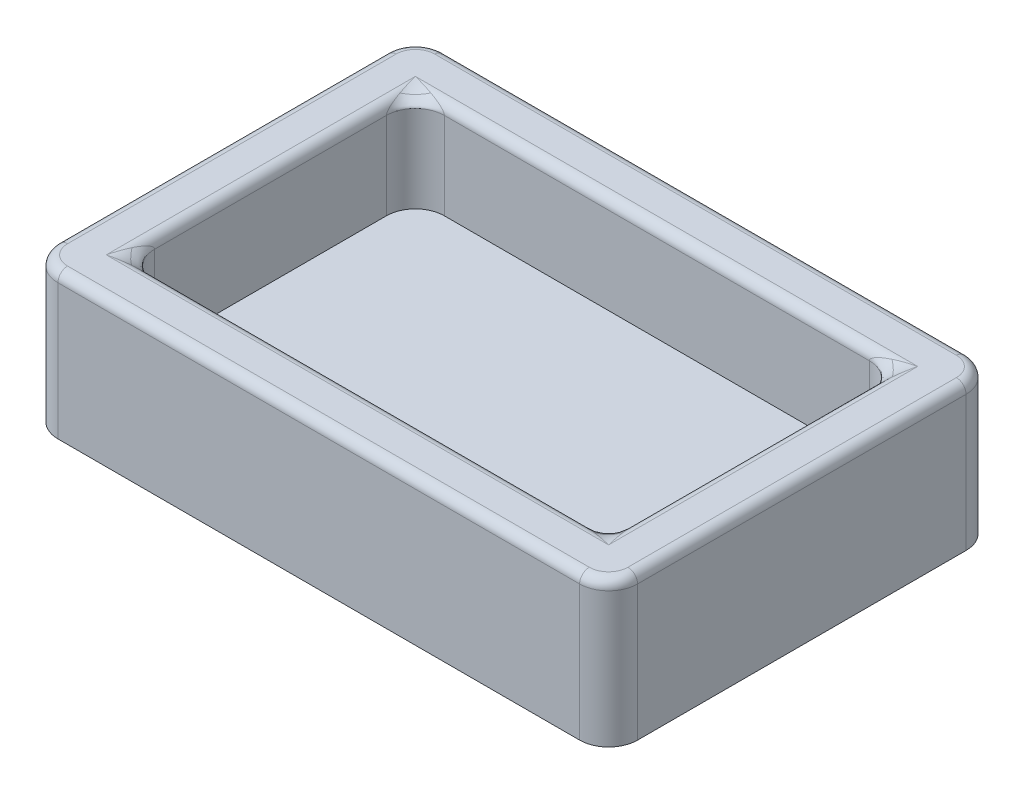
ISO-10303-21;
HEADER;
FILE_DESCRIPTION(('STEP AP214'),'2;1');
FILE_NAME('part.step','',(''),(''),'','','');
FILE_SCHEMA(('AUTOMOTIVE_DESIGN { 1 0 10303 214 1 1 1 1 }'));
ENDSEC;
DATA;
#1=APPLICATION_CONTEXT('core data for automotive mechanical design processes');
#2=APPLICATION_PROTOCOL_DEFINITION('international standard','automotive_design',2000,#1);
#3=PRODUCT_CONTEXT('',#1,'mechanical');
#4=PRODUCT('Part','Part','',(#3));
#5=PRODUCT_RELATED_PRODUCT_CATEGORY('part','',(#4));
#6=PRODUCT_DEFINITION_FORMATION('','',#4);
#7=PRODUCT_DEFINITION_CONTEXT('part definition',#1,'design');
#8=PRODUCT_DEFINITION('design','',#6,#7);
#9=PRODUCT_DEFINITION_SHAPE('','',#8);
#10=(LENGTH_UNIT() NAMED_UNIT(*) SI_UNIT(.MILLI.,.METRE.));
#11=(NAMED_UNIT(*) PLANE_ANGLE_UNIT() SI_UNIT($,.RADIAN.));
#12=(NAMED_UNIT(*) SI_UNIT($,.STERADIAN.) SOLID_ANGLE_UNIT());
#13=UNCERTAINTY_MEASURE_WITH_UNIT(LENGTH_MEASURE(1.E-05),#10,'distance_accuracy_value','');
#14=(GEOMETRIC_REPRESENTATION_CONTEXT(3) GLOBAL_UNCERTAINTY_ASSIGNED_CONTEXT((#13)) GLOBAL_UNIT_ASSIGNED_CONTEXT((#10,
#11,#12)) REPRESENTATION_CONTEXT('',''));
#15=CARTESIAN_POINT('',(0.,0.,0.));
#16=DIRECTION('',(0.,0.,1.));
#17=DIRECTION('',(1.,0.,0.));
#18=AXIS2_PLACEMENT_3D('',#15,#16,#17);
#19=CARTESIAN_POINT('',(63.5,35.56,-30.48));
#20=CARTESIAN_POINT('',(63.5,35.6838929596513,-30.4800000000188));
#21=CARTESIAN_POINT('',(63.5092894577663,35.8075650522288,-30.5171578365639));
#22=CARTESIAN_POINT('',(63.5435581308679,36.0432828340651,-30.6542325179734));
#23=CARTESIAN_POINT('',(63.5683978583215,36.1551747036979,-30.7535914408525));
#24=CARTESIAN_POINT('',(63.6566213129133,36.4638287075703,-31.1064852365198));
#25=CARTESIAN_POINT('',(63.732253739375,36.6322817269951,-31.4090149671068));
#26=CARTESIAN_POINT('',(63.8792700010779,36.9041453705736,-31.9970799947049));
#27=CARTESIAN_POINT('',(63.9512247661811,37.0092933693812,-32.2848990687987));
#28=CARTESIAN_POINT('',(64.0827836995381,37.1825712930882,-32.8111347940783));
#29=CARTESIAN_POINT('',(64.1428648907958,37.2508058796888,-33.0514595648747));
#30=CARTESIAN_POINT('',(64.307389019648,37.4241469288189,-33.7095560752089));
#31=CARTESIAN_POINT('',(64.3967496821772,37.4994306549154,-34.0669987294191));
#32=CARTESIAN_POINT('',(64.5548196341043,37.6229837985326,-34.6992785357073));
#33=CARTESIAN_POINT('',(64.6234531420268,37.6697106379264,-34.9738125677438));
#34=CARTESIAN_POINT('',(64.6883983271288,37.7105285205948,-35.2335933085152));
#35=CARTESIAN_POINT('',(63.5,35.56,-38.1));
#36=CARTESIAN_POINT('',(63.499999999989,35.5544322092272,-38.0999999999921));
#37=CARTESIAN_POINT('',(63.4899222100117,35.5489827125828,-38.0899222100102));
#38=CARTESIAN_POINT('',(63.4528295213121,35.5435851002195,-38.0528295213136));
#39=CARTESIAN_POINT('',(63.4261960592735,35.5436854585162,-38.0261960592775));
#40=CARTESIAN_POINT('',(63.3335222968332,35.5567002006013,-37.9335222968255));
#41=CARTESIAN_POINT('',(63.2563071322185,35.5824172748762,-37.8563071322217));
#42=CARTESIAN_POINT('',(63.1192316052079,35.6620968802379,-37.7192316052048));
#43=CARTESIAN_POINT('',(63.0588279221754,35.7141080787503,-37.6588279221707));
#44=CARTESIAN_POINT('',(62.9664312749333,35.827938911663,-37.566431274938));
#45=CARTESIAN_POINT('',(62.9328068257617,35.8895230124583,-37.532806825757));
#46=CARTESIAN_POINT('',(62.8667732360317,36.0722341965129,-37.4667732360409));
#47=CARTESIAN_POINT('',(62.8624474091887,36.1972107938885,-37.4624474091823));
#48=CARTESIAN_POINT('',(62.8996905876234,36.4292498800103,-37.4996905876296));
#49=CARTESIAN_POINT('',(62.9399841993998,36.5400735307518,-37.5399841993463));
#50=CARTESIAN_POINT('',(62.9953754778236,36.6464679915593,-37.5953754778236));
#51=CARTESIAN_POINT('',(55.88,35.56,-38.1));
#52=CARTESIAN_POINT('',(55.8800000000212,35.6838929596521,-38.1));
#53=CARTESIAN_POINT('',(55.9171578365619,35.8075650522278,-38.1092894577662));
#54=CARTESIAN_POINT('',(56.0542325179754,36.0432828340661,-38.1435581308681));
#55=CARTESIAN_POINT('',(56.1535914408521,36.1551747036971,-38.1683978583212));
#56=CARTESIAN_POINT('',(56.5064852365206,36.4638287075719,-38.2566213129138));
#57=CARTESIAN_POINT('',(56.8090149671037,36.6322817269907,-38.3322537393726));
#58=CARTESIAN_POINT('',(57.3970799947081,36.904145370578,-38.4792700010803));
#59=CARTESIAN_POINT('',(57.6848990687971,37.0092933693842,-38.5512247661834));
#60=CARTESIAN_POINT('',(58.2111347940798,37.1825712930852,-38.6827836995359));
#61=CARTESIAN_POINT('',(58.4514595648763,37.2508058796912,-38.7428648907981));
#62=CARTESIAN_POINT('',(59.1095560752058,37.4241469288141,-38.9073890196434));
#63=CARTESIAN_POINT('',(59.4669987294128,37.4994306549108,-38.9967496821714));
#64=CARTESIAN_POINT('',(60.0992785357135,37.6229837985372,-39.1548196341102));
#65=CARTESIAN_POINT('',(60.3738125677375,37.6697106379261,-39.2234531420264));
#66=CARTESIAN_POINT('',(60.6335933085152,37.7105285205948,-39.2883983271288));
#67=(BOUNDED_SURFACE() B_SPLINE_SURFACE(2,3,((#19,#20,#21,#22,#23,#24,#25,#26,#27,#28,#29,#30,
#31,#32,#33,#34),(#35,#36,#37,#38,#39,#40,#41,#42,#43,#44,#45,#46,#47,#48,#49,#50),(#51,#52,#53,
#54,#55,#56,#57,#58,#59,#60,#61,#62,#63,#64,#65,#66)),.UNSPECIFIED.,.F.,.F.,
.F.) B_SPLINE_SURFACE_WITH_KNOTS((3,3),(4,2,2,2,2,2,2,4),(0.,1.),(0.,0.0720372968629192,
0.144074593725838,0.288149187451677,0.432223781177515,0.576298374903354,0.86444756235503,
1.15259674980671),.UNSPECIFIED.) GEOMETRIC_REPRESENTATION_ITEM() RATIONAL_B_SPLINE_SURFACE(((1.,
1.,1.,1.,1.,1.,1.,1.,1.,1.,1.,1.,1.,1.,1.,1.),(0.707106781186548,0.707097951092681,
0.708581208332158,0.714183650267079,0.718301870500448,0.733520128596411,0.747387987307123,
0.776290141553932,0.791285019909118,0.819104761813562,0.831981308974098,0.866323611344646,
0.883503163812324,0.90983718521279,0.919153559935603,0.926509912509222),(1.,1.,1.,1.,1.,1.,1.,
1.,1.,1.,1.,1.,1.,1.,1.,1.))) REPRESENTATION_ITEM('') SURFACE());
#68=CARTESIAN_POINT('',(64.6883983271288,37.7105285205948,-35.2335933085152));
#69=CARTESIAN_POINT('',(62.9953754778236,36.6464679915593,-37.5953754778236));
#70=CARTESIAN_POINT('',(60.6335933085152,37.7105285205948,-39.2883983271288));
#71=(BOUNDED_CURVE() B_SPLINE_CURVE(2,(#68,#69,#70),.UNSPECIFIED.,.F.,
.F.) B_SPLINE_CURVE_WITH_KNOTS((3,3),(0.,1.),
.UNSPECIFIED.) CURVE() GEOMETRIC_REPRESENTATION_ITEM() RATIONAL_B_SPLINE_CURVE((1.,
0.926509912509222,1.)) REPRESENTATION_ITEM(''));
#72=CARTESIAN_POINT('',(60.6335933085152,37.7105285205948,-39.2883983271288));
#73=VERTEX_POINT('',#72);
#74=CARTESIAN_POINT('',(64.6883983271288,37.7105285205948,-35.2335933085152));
#75=VERTEX_POINT('',#74);
#76=EDGE_CURVE('E11',#73,#75,#71,.F.);
#77=CARTESIAN_POINT('',(60.6335933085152,37.7105285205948,-39.2883983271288));
#78=CARTESIAN_POINT('',(60.3738125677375,37.6697106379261,-39.2234531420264));
#79=CARTESIAN_POINT('',(60.0992785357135,37.6229837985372,-39.1548196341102));
#80=CARTESIAN_POINT('',(59.4669987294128,37.4994306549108,-38.9967496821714));
#81=CARTESIAN_POINT('',(59.1095560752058,37.4241469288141,-38.9073890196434));
#82=CARTESIAN_POINT('',(58.4514595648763,37.2508058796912,-38.7428648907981));
#83=CARTESIAN_POINT('',(58.2111347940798,37.1825712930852,-38.6827836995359));
#84=CARTESIAN_POINT('',(57.6848990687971,37.0092933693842,-38.5512247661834));
#85=CARTESIAN_POINT('',(57.3970799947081,36.904145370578,-38.4792700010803));
#86=CARTESIAN_POINT('',(56.8090149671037,36.6322817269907,-38.3322537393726));
#87=CARTESIAN_POINT('',(56.5064852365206,36.4638287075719,-38.2566213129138));
#88=CARTESIAN_POINT('',(56.1535914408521,36.1551747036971,-38.1683978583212));
#89=CARTESIAN_POINT('',(56.0542325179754,36.0432828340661,-38.1435581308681));
#90=CARTESIAN_POINT('',(55.9171578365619,35.8075650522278,-38.1092894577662));
#91=CARTESIAN_POINT('',(55.8800000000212,35.6838929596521,-38.1));
#92=CARTESIAN_POINT('',(55.88,35.56,-38.1));
#93=(BOUNDED_CURVE() B_SPLINE_CURVE(3,(#77,#78,#79,#80,#81,#82,#83,#84,#85,#86,#87,#88,#89,#90,
#91,#92),.UNSPECIFIED.,.F.,.F.) B_SPLINE_CURVE_WITH_KNOTS((4,2,2,2,2,2,2,4),(0.,
0.288149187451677,0.576298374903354,0.720372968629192,0.86444756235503,1.00852215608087,
1.08055945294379,1.15259674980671),
.UNSPECIFIED.) CURVE() GEOMETRIC_REPRESENTATION_ITEM() RATIONAL_B_SPLINE_CURVE((1.,1.,1.,1.,1.,
1.,1.,1.,1.,1.,1.,1.,1.,1.,1.,1.)) REPRESENTATION_ITEM(''));
#94=CARTESIAN_POINT('',(55.88,35.56,-38.1));
#95=VERTEX_POINT('',#94);
#96=EDGE_CURVE('E627',#95,#73,#93,.F.);
#97=CARTESIAN_POINT('',(55.88,35.56,-38.1));
#98=CARTESIAN_POINT('',(63.5,35.56,-38.1));
#99=CARTESIAN_POINT('',(63.5,35.56,-30.48));
#100=(BOUNDED_CURVE() B_SPLINE_CURVE(2,(#97,#98,#99),.UNSPECIFIED.,.F.,
.F.) B_SPLINE_CURVE_WITH_KNOTS((3,3),(0.,1.),
.UNSPECIFIED.) CURVE() GEOMETRIC_REPRESENTATION_ITEM() RATIONAL_B_SPLINE_CURVE((1.,
0.707106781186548,1.)) REPRESENTATION_ITEM(''));
#101=CARTESIAN_POINT('',(63.5,35.56,-30.48));
#102=VERTEX_POINT('',#101);
#103=EDGE_CURVE('E685',#95,#102,#100,.T.);
#104=CARTESIAN_POINT('',(63.5,35.56,-30.48));
#105=CARTESIAN_POINT('',(63.4999999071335,35.5688506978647,-30.4799996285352));
#106=CARTESIAN_POINT('',(63.5000474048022,35.5777011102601,-30.4801896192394));
#107=CARTESIAN_POINT('',(63.5002360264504,35.5953956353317,-30.4809441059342));
#108=CARTESIAN_POINT('',(63.5003772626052,35.6042397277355,-30.4815090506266));
#109=CARTESIAN_POINT('',(63.500752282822,35.6219173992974,-30.4830091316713));
#110=CARTESIAN_POINT('',(63.5009863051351,35.6307508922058,-30.4839452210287));
#111=CARTESIAN_POINT('',(63.5015456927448,35.6484034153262,-30.4861827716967));
#112=CARTESIAN_POINT('',(63.5018714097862,35.6572222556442,-30.487485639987));
#113=CARTESIAN_POINT('',(63.5026130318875,35.6748415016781,-30.490452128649));
#114=CARTESIAN_POINT('',(63.5030293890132,35.6836415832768,-30.4921175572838));
#115=CARTESIAN_POINT('',(63.5039511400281,35.7012193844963,-30.4958045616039));
#116=CARTESIAN_POINT('',(63.5044570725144,35.7099966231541,-30.4978282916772));
#117=CARTESIAN_POINT('',(63.5055568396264,35.7275248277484,-30.5022273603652));
#118=CARTESIAN_POINT('',(63.5061512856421,35.7362751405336,-30.5046051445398));
#119=CARTESIAN_POINT('',(63.5074269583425,35.7537455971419,-30.5097078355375));
#120=CARTESIAN_POINT('',(63.5081088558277,35.7624649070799,-30.5124354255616));
#121=CARTESIAN_POINT('',(63.509558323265,35.779869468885,-30.5182332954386));
#122=CARTESIAN_POINT('',(63.5103266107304,35.7885537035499,-30.5213064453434));
#123=CARTESIAN_POINT('',(63.5119477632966,35.8058842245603,-30.5277910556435));
#124=CARTESIAN_POINT('',(63.5128013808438,35.8145293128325,-30.5312055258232));
#125=CARTESIAN_POINT('',(63.514592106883,35.8317776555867,-30.5383684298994));
#126=CARTESIAN_POINT('',(63.5155299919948,35.8403795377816,-30.542119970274));
#127=CARTESIAN_POINT('',(63.5174881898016,35.8575375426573,-30.5499527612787));
#128=CARTESIAN_POINT('',(63.5185092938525,35.8660921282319,-30.5540371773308));
#129=CARTESIAN_POINT('',(63.5206328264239,35.8831517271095,-30.5625313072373));
#130=CARTESIAN_POINT('',(63.5217360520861,35.8916550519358,-30.5669442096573));
#131=CARTESIAN_POINT('',(63.5240229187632,35.9086078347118,-30.5760916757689));
#132=CARTESIAN_POINT('',(63.5252073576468,35.9170554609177,-30.5808294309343));
#133=CARTESIAN_POINT('',(63.5276547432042,35.9338922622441,-30.5906189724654));
#134=CARTESIAN_POINT('',(63.5289184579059,35.9422795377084,-30.5956738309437));
#135=CARTESIAN_POINT('',(63.5315213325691,35.9589928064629,-30.606085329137));
#136=CARTESIAN_POINT('',(63.532861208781,35.9673168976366,-30.6114448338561));
#137=CARTESIAN_POINT('',(63.5370152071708,35.9923407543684,-30.6280608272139));
#138=CARTESIAN_POINT('',(63.5399192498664,36.0087881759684,-30.6396769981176));
#139=CARTESIAN_POINT('',(63.5459996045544,36.0414168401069,-30.6639984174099));
#140=CARTESIAN_POINT('',(63.5491807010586,36.0575828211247,-30.6767228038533));
#141=CARTESIAN_POINT('',(63.555797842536,36.089632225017,-30.703191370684));
#142=CARTESIAN_POINT('',(63.5592380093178,36.1055011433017,-30.7169520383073));
#143=CARTESIAN_POINT('',(63.5663556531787,36.1369373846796,-30.7454226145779));
#144=CARTESIAN_POINT('',(63.5700366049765,36.1524912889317,-30.7601464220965));
#145=CARTESIAN_POINT('',(63.5776180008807,36.1832798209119,-30.7904720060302));
#146=CARTESIAN_POINT('',(63.5815213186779,36.1985023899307,-30.8060852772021));
#147=CARTESIAN_POINT('',(63.5895304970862,36.2286055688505,-30.8381219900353));
#148=CARTESIAN_POINT('',(63.5936387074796,36.2434755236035,-30.8545548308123));
#149=CARTESIAN_POINT('',(63.602032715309,36.2728534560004,-30.8881308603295));
#150=CARTESIAN_POINT('',(63.606320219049,36.2873531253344,-30.9052808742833));
#151=CARTESIAN_POINT('',(63.6150508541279,36.3159842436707,-30.9402034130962));
#152=CARTESIAN_POINT('',(63.6194952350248,36.3301091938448,-30.9579809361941));
#153=CARTESIAN_POINT('',(63.6331100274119,36.3721411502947,-31.0124401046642));
#154=CARTESIAN_POINT('',(63.6424277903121,36.3992397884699,-31.0497111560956));
#155=CARTESIAN_POINT('',(63.6615197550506,36.4520042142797,-31.1260790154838));
#156=CARTESIAN_POINT('',(63.6712989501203,36.4776390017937,-31.1651957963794));
#157=CARTESIAN_POINT('',(63.691207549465,36.5274924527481,-31.2448301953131));
#158=CARTESIAN_POINT('',(63.7013395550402,36.5516933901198,-31.2853582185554));
#159=CARTESIAN_POINT('',(63.7218453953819,36.5986945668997,-31.367381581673));
#160=CARTESIAN_POINT('',(63.7322200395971,36.6214887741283,-31.4088801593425));
#161=CARTESIAN_POINT('',(63.7531024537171,36.6656955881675,-31.4924098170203));
#162=CARTESIAN_POINT('',(63.7636097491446,36.6871120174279,-31.5344389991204));
#163=CARTESIAN_POINT('',(63.7846485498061,36.7285775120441,-31.6185942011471));
#164=CARTESIAN_POINT('',(63.7951786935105,36.7486383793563,-31.6607147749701));
#165=CARTESIAN_POINT('',(63.8264141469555,36.8064130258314,-31.7856565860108));
#166=CARTESIAN_POINT('',(63.8472683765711,36.8427629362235,-31.8690735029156));
#167=CARTESIAN_POINT('',(63.888514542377,36.910899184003,-32.034058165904));
#168=CARTESIAN_POINT('',(63.9088949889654,36.9428046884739,-32.1155799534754));
#169=CARTESIAN_POINT('',(63.9489809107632,37.0025902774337,-32.2759236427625));
#170=CARTESIAN_POINT('',(63.9686763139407,37.0305860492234,-32.3547052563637));
#171=CARTESIAN_POINT('',(64.024883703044,37.1074722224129,-32.5795348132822));
#172=CARTESIAN_POINT('',(64.0615794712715,37.1540879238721,-32.7263178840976));
#173=CARTESIAN_POINT('',(64.1314107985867,37.2368416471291,-33.0056431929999));
#174=CARTESIAN_POINT('',(64.1645059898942,37.2735672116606,-33.1380239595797));
#175=CARTESIAN_POINT('',(64.2273813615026,37.339886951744,-33.3895254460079));
#176=CARTESIAN_POINT('',(64.257140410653,37.369824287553,-33.5085616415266));
#177=CARTESIAN_POINT('',(64.3138214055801,37.4241089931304,-33.7352856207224));
#178=CARTESIAN_POINT('',(64.3407287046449,37.4487158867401,-33.8429148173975));
#179=CARTESIAN_POINT('',(64.3921707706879,37.4935783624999,-34.0486830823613));
#180=CARTESIAN_POINT('',(64.4166957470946,37.5140259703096,-34.1467829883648));
#181=CARTESIAN_POINT('',(64.4638220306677,37.5520267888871,-34.3352881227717));
#182=CARTESIAN_POINT('',(64.4864186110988,37.5696803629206,-34.4256744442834));
#183=CARTESIAN_POINT('',(64.5300713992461,37.6026941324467,-34.60028559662));
#184=CARTESIAN_POINT('',(64.5511243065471,37.618128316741,-34.6844972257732));
#185=CARTESIAN_POINT('',(64.5920049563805,37.6470961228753,-34.848019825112));
#186=CARTESIAN_POINT('',(64.611830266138,37.6606882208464,-34.9273210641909));
#187=CARTESIAN_POINT('',(64.6505668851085,37.6864462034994,-35.0822675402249));
#188=CARTESIAN_POINT('',(64.6694767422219,37.6986491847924,-35.1579069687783));
#189=CARTESIAN_POINT('',(64.6883983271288,37.7105285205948,-35.2335933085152));
#190=B_SPLINE_CURVE_WITH_KNOTS('',3,(#104,#105,#106,#107,#108,#109,#110,#111,#112,#113,#114,
#115,#116,#117,#118,#119,#120,#121,#122,#123,#124,#125,#126,#127,#128,#129,#130,#131,#132,#133,
#134,#135,#136,#137,#138,#139,#140,#141,#142,#143,#144,#145,#146,#147,#148,#149,#150,#151,#152,
#153,#154,#155,#156,#157,#158,#159,#160,#161,#162,#163,#164,#165,#166,#167,#168,#169,#170,#171,
#172,#173,#174,#175,#176,#177,#178,#179,#180,#181,#182,#183,#184,#185,#186,#187,#188,#189),
.UNSPECIFIED.,.F.,.F.,(4,2,2,2,2,2,2,2,2,2,2,2,2,2,2,2,2,2,2,2,2,2,2,2,2,2,2,2,2,2,2,2,2,2,2,2,
2,2,2,2,2,2,4),(0.,0.0265494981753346,0.0531308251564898,0.0797808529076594,0.106534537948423,
0.13342484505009,0.160482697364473,0.187736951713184,0.215214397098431,0.24293977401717,
0.270935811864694,0.299223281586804,0.32782106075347,0.356746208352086,0.386014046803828,
0.415631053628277,0.445598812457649,0.506597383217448,0.569024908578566,0.632854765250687,
0.698030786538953,0.764471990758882,0.832076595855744,0.900655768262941,0.970057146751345,
1.1110267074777,1.25432108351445,1.39912228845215,1.5445065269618,1.68946827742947,
1.83293845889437,2.11290977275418,2.38251049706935,2.64017343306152,3.11498455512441,
3.53886063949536,3.91772985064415,4.25861911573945,4.56810429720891,4.85257633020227,
5.11706488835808,5.36565325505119,5.60239882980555),.UNSPECIFIED.);
#191=EDGE_CURVE('E642',#75,#102,#190,.F.);
#192=ORIENTED_EDGE('',*,*,#76,.F.);
#193=ORIENTED_EDGE('',*,*,#96,.F.);
#194=ORIENTED_EDGE('',*,*,#103,.T.);
#195=ORIENTED_EDGE('',*,*,#191,.F.);
#196=EDGE_LOOP('',(#192,#193,#194,#195));
#197=FACE_BOUND('',#196,.T.);
#198=ADVANCED_FACE('F33',(#197),#67,.F.);
#199=CARTESIAN_POINT('',(-63.5,35.56,30.48));
#200=CARTESIAN_POINT('',(-63.5,35.6838929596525,30.4800000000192));
#201=CARTESIAN_POINT('',(-63.5092894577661,35.8075650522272,30.5171578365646));
#202=CARTESIAN_POINT('',(-63.5435581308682,36.0432828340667,30.6542325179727));
#203=CARTESIAN_POINT('',(-63.5683978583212,36.1551747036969,30.753591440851));
#204=CARTESIAN_POINT('',(-63.6566213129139,36.4638287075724,31.106485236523));
#205=CARTESIAN_POINT('',(-63.7322537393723,36.6322817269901,31.4090149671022));
#206=CARTESIAN_POINT('',(-63.8792700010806,36.9041453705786,31.9970799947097));
#207=CARTESIAN_POINT('',(-63.9512247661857,37.0092933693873,32.2848990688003));
#208=CARTESIAN_POINT('',(-64.0827836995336,37.1825712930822,32.8111347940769));
#209=CARTESIAN_POINT('',(-64.1428648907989,37.250805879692,33.0514595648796));
#210=CARTESIAN_POINT('',(-64.3073890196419,37.4241469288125,33.7095560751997));
#211=CARTESIAN_POINT('',(-64.3967496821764,37.4994306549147,34.0669987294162));
#212=CARTESIAN_POINT('',(-64.5548196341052,37.6229837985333,34.6992785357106));
#213=CARTESIAN_POINT('',(-64.6234531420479,37.6697106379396,34.9738125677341));
#214=CARTESIAN_POINT('',(-64.6883983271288,37.7105285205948,35.2335933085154));
#215=CARTESIAN_POINT('',(-63.5,35.56,38.1));
#216=CARTESIAN_POINT('',(-63.4999999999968,35.5544322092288,38.0999999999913));
#217=CARTESIAN_POINT('',(-63.4899222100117,35.5489827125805,38.089922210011));
#218=CARTESIAN_POINT('',(-63.4528295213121,35.5435851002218,38.0528295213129));
#219=CARTESIAN_POINT('',(-63.4261960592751,35.5436854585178,38.0261960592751));
#220=CARTESIAN_POINT('',(-63.3335222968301,35.5567002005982,37.9335222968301));
#221=CARTESIAN_POINT('',(-63.2563071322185,35.5824172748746,37.8563071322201));
#222=CARTESIAN_POINT('',(-63.1192316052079,35.6620968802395,37.7192316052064));
#223=CARTESIAN_POINT('',(-63.0588279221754,35.714108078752,37.6588279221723));
#224=CARTESIAN_POINT('',(-62.9664312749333,35.8279389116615,37.5664312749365));
#225=CARTESIAN_POINT('',(-62.9328068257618,35.8895230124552,37.5328068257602));
#226=CARTESIAN_POINT('',(-62.8667732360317,36.0722341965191,37.4667732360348));
#227=CARTESIAN_POINT('',(-62.862447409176,36.1972107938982,37.4624474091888));
#228=CARTESIAN_POINT('',(-62.8996905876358,36.4292498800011,37.4996905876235));
#229=CARTESIAN_POINT('',(-62.9399841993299,36.5400735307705,37.5399841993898));
#230=CARTESIAN_POINT('',(-62.9953754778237,36.6464679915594,37.5953754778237));
#231=CARTESIAN_POINT('',(-55.88,35.56,38.1));
#232=CARTESIAN_POINT('',(-55.8800000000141,35.6838929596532,38.1));
#233=CARTESIAN_POINT('',(-55.9171578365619,35.8075650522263,38.109289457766));
#234=CARTESIAN_POINT('',(-56.0542325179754,36.0432828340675,38.1435581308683));
#235=CARTESIAN_POINT('',(-56.1535914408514,36.1551747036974,38.1683978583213));
#236=CARTESIAN_POINT('',(-56.5064852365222,36.4638287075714,38.2566213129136));
#237=CARTESIAN_POINT('',(-56.8090149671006,36.6322817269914,38.332253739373));
#238=CARTESIAN_POINT('',(-57.3970799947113,36.9041453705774,38.47927000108));
#239=CARTESIAN_POINT('',(-57.6848990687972,37.0092933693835,38.5512247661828));
#240=CARTESIAN_POINT('',(-58.21113479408,37.182571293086,38.6827836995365));
#241=CARTESIAN_POINT('',(-58.4514595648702,37.250805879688,38.7428648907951));
#242=CARTESIAN_POINT('',(-59.1095560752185,37.4241469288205,38.9073890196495));
#243=CARTESIAN_POINT('',(-59.4669987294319,37.4994306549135,38.9967496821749));
#244=CARTESIAN_POINT('',(-60.0992785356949,37.6229837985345,39.1548196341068));
#245=CARTESIAN_POINT('',(-60.3738125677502,37.669710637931,39.2234531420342));
#246=CARTESIAN_POINT('',(-60.6335933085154,37.7105285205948,39.2883983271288));
#247=(BOUNDED_SURFACE() B_SPLINE_SURFACE(2,3,((#199,#200,#201,#202,#203,#204,#205,#206,#207,
#208,#209,#210,#211,#212,#213,#214),(#215,#216,#217,#218,#219,#220,#221,#222,#223,#224,#225,
#226,#227,#228,#229,#230),(#231,#232,#233,#234,#235,#236,#237,#238,#239,#240,#241,#242,#243,
#244,#245,#246)),.UNSPECIFIED.,.F.,.F.,.F.) B_SPLINE_SURFACE_WITH_KNOTS((3,3),(4,2,2,2,2,2,2,4),
(0.,1.),(0.,0.0720372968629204,0.144074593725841,0.288149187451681,0.432223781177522,
0.576298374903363,0.864447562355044,1.15259674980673),
.UNSPECIFIED.) GEOMETRIC_REPRESENTATION_ITEM() RATIONAL_B_SPLINE_SURFACE(((1.,1.,1.,1.,1.,1.,1.,
1.,1.,1.,1.,1.,1.,1.,1.,1.),(0.707106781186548,0.707097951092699,0.708581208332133,
0.714183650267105,0.718301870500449,0.733520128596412,0.747387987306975,0.776290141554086,
0.791285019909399,0.819104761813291,0.831981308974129,0.866323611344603,0.88350316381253,
0.909837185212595,0.919153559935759,0.926509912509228),(1.,1.,1.,1.,1.,1.,1.,1.,1.,1.,1.,1.,1.,
1.,1.,1.))) REPRESENTATION_ITEM('') SURFACE());
#248=CARTESIAN_POINT('',(-64.6883983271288,37.7105285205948,35.2335933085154));
#249=CARTESIAN_POINT('',(-62.9953754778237,36.6464679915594,37.5953754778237));
#250=CARTESIAN_POINT('',(-60.6335933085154,37.7105285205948,39.2883983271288));
#251=(BOUNDED_CURVE() B_SPLINE_CURVE(2,(#248,#249,#250),.UNSPECIFIED.,.F.,
.F.) B_SPLINE_CURVE_WITH_KNOTS((3,3),(0.,1.),
.UNSPECIFIED.) CURVE() GEOMETRIC_REPRESENTATION_ITEM() RATIONAL_B_SPLINE_CURVE((1.,
0.926509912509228,1.)) REPRESENTATION_ITEM(''));
#252=CARTESIAN_POINT('',(-60.6335933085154,37.7105285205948,39.2883983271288));
#253=VERTEX_POINT('',#252);
#254=CARTESIAN_POINT('',(-64.6883983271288,37.7105285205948,35.2335933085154));
#255=VERTEX_POINT('',#254);
#256=EDGE_CURVE('E46',#253,#255,#251,.F.);
#257=CARTESIAN_POINT('',(-60.6335933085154,37.7105285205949,39.2883983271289));
#258=CARTESIAN_POINT('',(-60.3738125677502,37.669710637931,39.2234531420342));
#259=CARTESIAN_POINT('',(-60.0992785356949,37.6229837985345,39.1548196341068));
#260=CARTESIAN_POINT('',(-59.4669987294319,37.4994306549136,38.9967496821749));
#261=CARTESIAN_POINT('',(-59.1095560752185,37.4241469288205,38.9073890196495));
#262=CARTESIAN_POINT('',(-58.4514595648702,37.250805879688,38.7428648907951));
#263=CARTESIAN_POINT('',(-58.21113479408,37.182571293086,38.6827836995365));
#264=CARTESIAN_POINT('',(-57.6848990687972,37.0092933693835,38.5512247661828));
#265=CARTESIAN_POINT('',(-57.3970799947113,36.9041453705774,38.47927000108));
#266=CARTESIAN_POINT('',(-56.8090149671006,36.6322817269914,38.332253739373));
#267=CARTESIAN_POINT('',(-56.5064852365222,36.4638287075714,38.2566213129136));
#268=CARTESIAN_POINT('',(-56.1535914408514,36.1551747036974,38.1683978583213));
#269=CARTESIAN_POINT('',(-56.0542325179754,36.0432828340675,38.1435581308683));
#270=CARTESIAN_POINT('',(-55.9171578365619,35.8075650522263,38.109289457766));
#271=CARTESIAN_POINT('',(-55.8800000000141,35.6838929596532,38.1));
#272=CARTESIAN_POINT('',(-55.88,35.56,38.1));
#273=(BOUNDED_CURVE() B_SPLINE_CURVE(3,(#257,#258,#259,#260,#261,#262,#263,#264,#265,#266,#267,
#268,#269,#270,#271,#272),.UNSPECIFIED.,.F.,.F.) B_SPLINE_CURVE_WITH_KNOTS((4,2,2,2,2,2,2,4),
(0.,0.288149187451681,0.576298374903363,0.720372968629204,0.864447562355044,1.00852215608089,
1.08055945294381,1.15259674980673),
.UNSPECIFIED.) CURVE() GEOMETRIC_REPRESENTATION_ITEM() RATIONAL_B_SPLINE_CURVE((1.,1.,1.,1.,1.,
1.,1.,1.,1.,1.,1.,1.,1.,1.,1.,1.)) REPRESENTATION_ITEM(''));
#274=CARTESIAN_POINT('',(-55.88,35.56,38.1));
#275=VERTEX_POINT('',#274);
#276=EDGE_CURVE('E246',#275,#253,#273,.F.);
#277=CARTESIAN_POINT('',(-55.88,35.56,38.1));
#278=CARTESIAN_POINT('',(-63.5,35.56,38.1));
#279=CARTESIAN_POINT('',(-63.5,35.56,30.48));
#280=(BOUNDED_CURVE() B_SPLINE_CURVE(2,(#277,#278,#279),.UNSPECIFIED.,.F.,
.F.) B_SPLINE_CURVE_WITH_KNOTS((3,3),(0.,1.),
.UNSPECIFIED.) CURVE() GEOMETRIC_REPRESENTATION_ITEM() RATIONAL_B_SPLINE_CURVE((1.,
0.707106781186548,1.)) REPRESENTATION_ITEM(''));
#281=CARTESIAN_POINT('',(-63.5,35.56,30.48));
#282=VERTEX_POINT('',#281);
#283=EDGE_CURVE('E600',#275,#282,#280,.T.);
#284=CARTESIAN_POINT('',(-63.5,35.56,30.48));
#285=CARTESIAN_POINT('',(-63.4999999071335,35.5688506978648,30.4799996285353));
#286=CARTESIAN_POINT('',(-63.5000474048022,35.5777011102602,30.4801896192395));
#287=CARTESIAN_POINT('',(-63.5002360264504,35.595395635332,30.4809441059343));
#288=CARTESIAN_POINT('',(-63.5003772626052,35.6042397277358,30.4815090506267));
#289=CARTESIAN_POINT('',(-63.500752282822,35.6219173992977,30.4830091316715));
#290=CARTESIAN_POINT('',(-63.5009863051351,35.6307508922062,30.483945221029));
#291=CARTESIAN_POINT('',(-63.5015456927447,35.6484034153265,30.4861827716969));
#292=CARTESIAN_POINT('',(-63.5018714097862,35.6572222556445,30.4874856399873));
#293=CARTESIAN_POINT('',(-63.5026130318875,35.6748415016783,30.4904521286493));
#294=CARTESIAN_POINT('',(-63.5030293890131,35.6836415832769,30.4921175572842));
#295=CARTESIAN_POINT('',(-63.503951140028,35.7012193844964,30.4958045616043));
#296=CARTESIAN_POINT('',(-63.5044570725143,35.7099966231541,30.4978282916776));
#297=CARTESIAN_POINT('',(-63.5055568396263,35.7275248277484,30.5022273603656));
#298=CARTESIAN_POINT('',(-63.506151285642,35.7362751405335,30.5046051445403));
#299=CARTESIAN_POINT('',(-63.5074269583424,35.7537455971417,30.5097078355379));
#300=CARTESIAN_POINT('',(-63.5081088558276,35.7624649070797,30.5124354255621));
#301=CARTESIAN_POINT('',(-63.5095583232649,35.7798694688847,30.518233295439));
#302=CARTESIAN_POINT('',(-63.5103266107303,35.7885537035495,30.5213064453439));
#303=CARTESIAN_POINT('',(-63.5119477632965,35.8058842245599,30.527791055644));
#304=CARTESIAN_POINT('',(-63.5128013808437,35.8145293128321,30.5312055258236));
#305=CARTESIAN_POINT('',(-63.5145921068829,35.8317776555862,30.5383684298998));
#306=CARTESIAN_POINT('',(-63.5155299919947,35.8403795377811,30.5421199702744));
#307=CARTESIAN_POINT('',(-63.5174881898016,35.8575375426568,30.5499527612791));
#308=CARTESIAN_POINT('',(-63.5185092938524,35.8660921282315,30.5540371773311));
#309=CARTESIAN_POINT('',(-63.5206328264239,35.8831517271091,30.5625313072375));
#310=CARTESIAN_POINT('',(-63.5217360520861,35.8916550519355,30.5669442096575));
#311=CARTESIAN_POINT('',(-63.5240229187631,35.9086078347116,30.5760916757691));
#312=CARTESIAN_POINT('',(-63.5252073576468,35.9170554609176,30.5808294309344));
#313=CARTESIAN_POINT('',(-63.5276547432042,35.9338922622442,30.5906189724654));
#314=CARTESIAN_POINT('',(-63.5289184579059,35.9422795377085,30.5956738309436));
#315=CARTESIAN_POINT('',(-63.5315213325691,35.9589928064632,30.6060853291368));
#316=CARTESIAN_POINT('',(-63.532861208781,35.967316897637,30.6114448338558));
#317=CARTESIAN_POINT('',(-63.5370152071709,35.9923407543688,30.6280608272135));
#318=CARTESIAN_POINT('',(-63.5399192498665,36.0087881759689,30.6396769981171));
#319=CARTESIAN_POINT('',(-63.5459996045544,36.0414168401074,30.6639984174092));
#320=CARTESIAN_POINT('',(-63.5491807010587,36.0575828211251,30.6767228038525));
#321=CARTESIAN_POINT('',(-63.555797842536,36.0896322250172,30.7031913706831));
#322=CARTESIAN_POINT('',(-63.5592380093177,36.1055011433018,30.7169520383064));
#323=CARTESIAN_POINT('',(-63.5663556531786,36.1369373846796,30.7454226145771));
#324=CARTESIAN_POINT('',(-63.5700366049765,36.1524912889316,30.7601464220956));
#325=CARTESIAN_POINT('',(-63.5776180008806,36.1832798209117,30.7904720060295));
#326=CARTESIAN_POINT('',(-63.5815213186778,36.1985023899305,30.8060852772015));
#327=CARTESIAN_POINT('',(-63.5895304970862,36.2286055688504,30.838121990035));
#328=CARTESIAN_POINT('',(-63.5936387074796,36.2434755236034,30.8545548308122));
#329=CARTESIAN_POINT('',(-63.6020327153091,36.2728534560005,30.8881308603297));
#330=CARTESIAN_POINT('',(-63.6063202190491,36.2873531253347,30.9052808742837));
#331=CARTESIAN_POINT('',(-63.6150508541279,36.3159842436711,30.9402034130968));
#332=CARTESIAN_POINT('',(-63.6194952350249,36.3301091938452,30.9579809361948));
#333=CARTESIAN_POINT('',(-63.6331100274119,36.372141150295,31.012440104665));
#334=CARTESIAN_POINT('',(-63.6424277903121,36.3992397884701,31.0497111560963));
#335=CARTESIAN_POINT('',(-63.6615197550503,36.4520042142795,31.1260790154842));
#336=CARTESIAN_POINT('',(-63.6712989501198,36.4776390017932,31.1651957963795));
#337=CARTESIAN_POINT('',(-63.6912075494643,36.5274924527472,31.2448301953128));
#338=CARTESIAN_POINT('',(-63.7013395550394,36.5516933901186,31.2853582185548));
#339=CARTESIAN_POINT('',(-63.7218453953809,36.5986945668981,31.367381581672));
#340=CARTESIAN_POINT('',(-63.732220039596,36.6214887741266,31.4088801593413));
#341=CARTESIAN_POINT('',(-63.7531024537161,36.6656955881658,31.492409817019));
#342=CARTESIAN_POINT('',(-63.7636097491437,36.6871120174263,31.5344389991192));
#343=CARTESIAN_POINT('',(-63.7846485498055,36.7285775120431,31.6185942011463));
#344=CARTESIAN_POINT('',(-63.7951786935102,36.7486383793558,31.6607147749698));
#345=CARTESIAN_POINT('',(-63.8264141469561,36.8064130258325,31.7856565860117));
#346=CARTESIAN_POINT('',(-63.8472683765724,36.8427629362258,31.8690735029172));
#347=CARTESIAN_POINT('',(-63.8885145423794,36.9108991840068,32.0340581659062));
#348=CARTESIAN_POINT('',(-63.9088949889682,36.9428046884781,32.1155799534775));
#349=CARTESIAN_POINT('',(-63.9489809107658,37.0025902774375,32.2759236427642));
#350=CARTESIAN_POINT('',(-63.9686763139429,37.0305860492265,32.3547052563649));
#351=CARTESIAN_POINT('',(-64.0248837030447,37.1074722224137,32.5795348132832));
#352=CARTESIAN_POINT('',(-64.0615794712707,37.1540879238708,32.726317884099));
#353=CARTESIAN_POINT('',(-64.1314107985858,37.2368416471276,33.0056431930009));
#354=CARTESIAN_POINT('',(-64.1645059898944,37.2735672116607,33.1380239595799));
#355=CARTESIAN_POINT('',(-64.2273813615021,37.3398869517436,33.3895254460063));
#356=CARTESIAN_POINT('',(-64.257140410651,37.3698242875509,33.5085616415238));
#357=CARTESIAN_POINT('',(-64.3138214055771,37.4241089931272,33.7352856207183));
#358=CARTESIAN_POINT('',(-64.3407287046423,37.4487158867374,33.8429148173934));
#359=CARTESIAN_POINT('',(-64.3921707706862,37.4935783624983,34.0486830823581));
#360=CARTESIAN_POINT('',(-64.4166957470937,37.5140259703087,34.1467829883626));
#361=CARTESIAN_POINT('',(-64.4638220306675,37.5520267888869,34.3352881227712));
#362=CARTESIAN_POINT('',(-64.4864186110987,37.5696803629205,34.4256744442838));
#363=CARTESIAN_POINT('',(-64.5300713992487,37.6026941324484,34.6002855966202));
#364=CARTESIAN_POINT('',(-64.5511243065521,37.6181283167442,34.6844972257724));
#365=CARTESIAN_POINT('',(-64.5920049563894,37.6470961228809,34.8480198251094));
#366=CARTESIAN_POINT('',(-64.6118302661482,37.6606882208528,34.9273210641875));
#367=CARTESIAN_POINT('',(-64.6505668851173,37.6864462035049,35.0822675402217));
#368=CARTESIAN_POINT('',(-64.6694767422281,37.6986491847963,35.1579069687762));
#369=CARTESIAN_POINT('',(-64.6883983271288,37.7105285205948,35.2335933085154));
#370=B_SPLINE_CURVE_WITH_KNOTS('',3,(#284,#285,#286,#287,#288,#289,#290,#291,#292,#293,#294,
#295,#296,#297,#298,#299,#300,#301,#302,#303,#304,#305,#306,#307,#308,#309,#310,#311,#312,#313,
#314,#315,#316,#317,#318,#319,#320,#321,#322,#323,#324,#325,#326,#327,#328,#329,#330,#331,#332,
#333,#334,#335,#336,#337,#338,#339,#340,#341,#342,#343,#344,#345,#346,#347,#348,#349,#350,#351,
#352,#353,#354,#355,#356,#357,#358,#359,#360,#361,#362,#363,#364,#365,#366,#367,#368,#369),
.UNSPECIFIED.,.F.,.F.,(4,2,2,2,2,2,2,2,2,2,2,2,2,2,2,2,2,2,2,2,2,2,2,2,2,2,2,2,2,2,2,2,2,2,2,2,
2,2,2,2,2,2,4),(0.,0.0265494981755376,0.0531308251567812,0.0797808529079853,0.10653453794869,
0.133424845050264,0.160482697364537,0.187736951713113,0.215214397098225,0.242939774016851,
0.270935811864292,0.299223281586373,0.327821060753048,0.356746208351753,0.386014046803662,
0.415631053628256,0.445598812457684,0.506597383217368,0.569024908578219,0.632854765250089,
0.698030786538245,0.764471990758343,0.832076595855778,0.900655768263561,0.970057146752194,
1.11102670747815,1.25432108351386,1.39912228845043,1.54450652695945,1.68946827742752,
1.83293845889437,2.11290977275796,2.38251049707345,2.64017343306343,3.11498455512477,
3.53886063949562,3.91772985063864,4.25861911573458,4.56810429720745,4.8525763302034,
5.117064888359,5.36565325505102,5.60239882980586),.UNSPECIFIED.);
#371=EDGE_CURVE('E83',#255,#282,#370,.F.);
#372=ORIENTED_EDGE('',*,*,#256,.F.);
#373=ORIENTED_EDGE('',*,*,#276,.F.);
#374=ORIENTED_EDGE('',*,*,#283,.T.);
#375=ORIENTED_EDGE('',*,*,#371,.F.);
#376=EDGE_LOOP('',(#372,#373,#374,#375));
#377=FACE_BOUND('',#376,.T.);
#378=ADVANCED_FACE('F566',(#377),#247,.F.);
#379=CARTESIAN_POINT('',(55.88,35.56,38.1));
#380=CARTESIAN_POINT('',(55.8800000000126,35.6838929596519,38.1));
#381=CARTESIAN_POINT('',(55.917157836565,35.807565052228,38.1092894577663));
#382=CARTESIAN_POINT('',(56.0542325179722,36.0432828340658,38.1435581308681));
#383=CARTESIAN_POINT('',(56.153591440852,36.1551747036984,38.1683978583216));
#384=CARTESIAN_POINT('',(56.5064852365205,36.4638287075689,38.2566213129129));
#385=CARTESIAN_POINT('',(56.8090149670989,36.6322817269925,38.3322537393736));
#386=CARTESIAN_POINT('',(57.3970799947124,36.904145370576,38.4792700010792));
#387=CARTESIAN_POINT('',(57.6848990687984,37.0092933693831,38.5512247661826));
#388=CARTESIAN_POINT('',(58.2111347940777,37.182571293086,38.6827836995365));
#389=CARTESIAN_POINT('',(58.4514595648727,37.2508058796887,38.7428648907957));
#390=CARTESIAN_POINT('',(59.1095560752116,37.4241469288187,38.9073890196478));
#391=CARTESIAN_POINT('',(59.4669987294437,37.49943065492,38.9967496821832));
#392=CARTESIAN_POINT('',(60.0992785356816,37.6229837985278,39.1548196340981));
#393=CARTESIAN_POINT('',(60.3738125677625,37.6697106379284,39.22345314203));
#394=CARTESIAN_POINT('',(60.6335933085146,37.7105285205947,39.2883983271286));
#395=CARTESIAN_POINT('',(63.5,35.56,38.1));
#396=CARTESIAN_POINT('',(63.4999999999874,35.5544322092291,38.0999999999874));
#397=CARTESIAN_POINT('',(63.4899222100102,35.5489827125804,38.0899222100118));
#398=CARTESIAN_POINT('',(63.4528295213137,35.5435851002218,38.0528295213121));
#399=CARTESIAN_POINT('',(63.4261960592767,35.5436854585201,38.0261960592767));
#400=CARTESIAN_POINT('',(63.333522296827,35.5567002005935,37.933522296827));
#401=CARTESIAN_POINT('',(63.2563071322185,35.5824172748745,37.8563071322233));
#402=CARTESIAN_POINT('',(63.119231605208,35.6620968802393,37.7192316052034));
#403=CARTESIAN_POINT('',(63.0588279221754,35.7141080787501,37.6588279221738));
#404=CARTESIAN_POINT('',(62.9664312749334,35.8279389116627,37.5664312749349));
#405=CARTESIAN_POINT('',(62.9328068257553,35.8895230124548,37.5328068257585));
#406=CARTESIAN_POINT('',(62.8667732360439,36.0722341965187,37.4667732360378));
#407=CARTESIAN_POINT('',(62.8624474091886,36.1972107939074,37.4624474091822));
#408=CARTESIAN_POINT('',(62.8996905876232,36.4292498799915,37.4996905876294));
#409=CARTESIAN_POINT('',(62.9399841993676,36.540073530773,37.5399841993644));
#410=CARTESIAN_POINT('',(62.9953754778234,36.646467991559,37.5953754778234));
#411=CARTESIAN_POINT('',(63.5,35.56,30.48));
#412=CARTESIAN_POINT('',(63.5,35.6838929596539,30.4800000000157));
#413=CARTESIAN_POINT('',(63.5092894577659,35.8075650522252,30.5171578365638));
#414=CARTESIAN_POINT('',(63.5435581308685,36.0432828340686,30.6542325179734));
#415=CARTESIAN_POINT('',(63.5683978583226,36.155174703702,30.753591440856));
#416=CARTESIAN_POINT('',(63.6566213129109,36.4638287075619,31.1064852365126));
#417=CARTESIAN_POINT('',(63.7322537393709,36.6322817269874,31.4090149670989));
#418=CARTESIAN_POINT('',(63.879270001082,36.904145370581,31.9970799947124));
#419=CARTESIAN_POINT('',(63.951224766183,37.0092933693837,32.2848990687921));
#420=CARTESIAN_POINT('',(64.0827836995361,37.1825712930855,32.811134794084));
#421=CARTESIAN_POINT('',(64.1428648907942,37.2508058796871,33.051459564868));
#422=CARTESIAN_POINT('',(64.3073890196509,37.4241469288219,33.709556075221));
#423=CARTESIAN_POINT('',(64.3967496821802,37.4994306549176,34.0669987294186));
#424=CARTESIAN_POINT('',(64.5548196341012,37.6229837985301,34.6992785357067));
#425=CARTESIAN_POINT('',(64.623453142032,37.6697106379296,34.9738125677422));
#426=CARTESIAN_POINT('',(64.6883983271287,37.7105285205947,35.2335933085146));
#427=(BOUNDED_SURFACE() B_SPLINE_SURFACE(2,3,((#379,#380,#381,#382,#383,#384,#385,#386,#387,
#388,#389,#390,#391,#392,#393,#394),(#395,#396,#397,#398,#399,#400,#401,#402,#403,#404,#405,
#406,#407,#408,#409,#410),(#411,#412,#413,#414,#415,#416,#417,#418,#419,#420,#421,#422,#423,
#424,#425,#426)),.UNSPECIFIED.,.F.,.F.,.F.) B_SPLINE_SURFACE_WITH_KNOTS((3,3),(4,2,2,2,2,2,2,4),
(0.,1.),(0.,0.0720372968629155,0.144074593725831,0.288149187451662,0.432223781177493,
0.576298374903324,0.864447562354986,1.15259674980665),
.UNSPECIFIED.) GEOMETRIC_REPRESENTATION_ITEM() RATIONAL_B_SPLINE_SURFACE(((1.,1.,1.,1.,1.,1.,1.,
1.,1.,1.,1.,1.,1.,1.,1.,1.),(0.707106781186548,0.7070979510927,0.708581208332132,
0.714183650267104,0.71830187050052,0.733520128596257,0.747387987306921,0.776290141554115,
0.791285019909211,0.819104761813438,0.831981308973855,0.866323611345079,0.883503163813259,
0.909837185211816,0.919153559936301,0.926509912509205),(1.,1.,1.,1.,1.,1.,1.,1.,1.,1.,1.,1.,1.,
1.,1.,1.))) REPRESENTATION_ITEM('') SURFACE());
#428=CARTESIAN_POINT('',(60.6335933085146,37.7105285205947,39.2883983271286));
#429=CARTESIAN_POINT('',(62.9953754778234,36.646467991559,37.5953754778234));
#430=CARTESIAN_POINT('',(64.6883983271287,37.7105285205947,35.2335933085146));
#431=(BOUNDED_CURVE() B_SPLINE_CURVE(2,(#428,#429,#430),.UNSPECIFIED.,.F.,
.F.) B_SPLINE_CURVE_WITH_KNOTS((3,3),(0.,1.),
.UNSPECIFIED.) CURVE() GEOMETRIC_REPRESENTATION_ITEM() RATIONAL_B_SPLINE_CURVE((1.,
0.926509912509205,1.)) REPRESENTATION_ITEM(''));
#432=CARTESIAN_POINT('',(64.6883983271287,37.7105285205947,35.2335933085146));
#433=VERTEX_POINT('',#432);
#434=CARTESIAN_POINT('',(60.6335933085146,37.7105285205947,39.2883983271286));
#435=VERTEX_POINT('',#434);
#436=EDGE_CURVE('E119',#433,#435,#431,.F.);
#437=CARTESIAN_POINT('',(64.6883983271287,37.7105285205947,35.2335933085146));
#438=CARTESIAN_POINT('',(64.6234531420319,37.6697106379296,34.9738125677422));
#439=CARTESIAN_POINT('',(64.5548196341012,37.6229837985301,34.6992785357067));
#440=CARTESIAN_POINT('',(64.3967496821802,37.4994306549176,34.0669987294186));
#441=CARTESIAN_POINT('',(64.3073890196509,37.4241469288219,33.709556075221));
#442=CARTESIAN_POINT('',(64.1428648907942,37.2508058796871,33.051459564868));
#443=CARTESIAN_POINT('',(64.0827836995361,37.1825712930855,32.8111347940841));
#444=CARTESIAN_POINT('',(63.951224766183,37.0092933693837,32.2848990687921));
#445=CARTESIAN_POINT('',(63.8792700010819,36.904145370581,31.9970799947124));
#446=CARTESIAN_POINT('',(63.7322537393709,36.6322817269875,31.4090149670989));
#447=CARTESIAN_POINT('',(63.6566213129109,36.4638287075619,31.1064852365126));
#448=CARTESIAN_POINT('',(63.5683978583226,36.155174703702,30.753591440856));
#449=CARTESIAN_POINT('',(63.5435581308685,36.0432828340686,30.6542325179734));
#450=CARTESIAN_POINT('',(63.5092894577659,35.8075650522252,30.5171578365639));
#451=CARTESIAN_POINT('',(63.5,35.6838929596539,30.4800000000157));
#452=CARTESIAN_POINT('',(63.5,35.56,30.48));
#453=(BOUNDED_CURVE() B_SPLINE_CURVE(3,(#437,#438,#439,#440,#441,#442,#443,#444,#445,#446,#447,
#448,#449,#450,#451,#452),.UNSPECIFIED.,.F.,.F.) B_SPLINE_CURVE_WITH_KNOTS((4,2,2,2,2,2,2,4),
(0.,0.288149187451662,0.576298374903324,0.720372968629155,0.864447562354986,1.00852215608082,
1.08055945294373,1.15259674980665),
.UNSPECIFIED.) CURVE() GEOMETRIC_REPRESENTATION_ITEM() RATIONAL_B_SPLINE_CURVE((1.,1.,1.,1.,1.,
1.,0.999999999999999,0.999999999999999,0.999999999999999,0.999999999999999,0.999999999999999,
0.999999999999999,0.999999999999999,0.999999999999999,0.999999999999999,0.999999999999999)) REPRESENTATION_ITEM(''));
#454=CARTESIAN_POINT('',(63.5,35.56,30.48));
#455=VERTEX_POINT('',#454);
#456=EDGE_CURVE('E754',#455,#433,#453,.F.);
#457=CARTESIAN_POINT('',(63.5,35.56,30.48));
#458=CARTESIAN_POINT('',(63.5,35.56,38.1));
#459=CARTESIAN_POINT('',(55.88,35.56,38.1));
#460=(BOUNDED_CURVE() B_SPLINE_CURVE(2,(#457,#458,#459),.UNSPECIFIED.,.F.,
.F.) B_SPLINE_CURVE_WITH_KNOTS((3,3),(0.,1.),
.UNSPECIFIED.) CURVE() GEOMETRIC_REPRESENTATION_ITEM() RATIONAL_B_SPLINE_CURVE((1.,
0.707106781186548,1.)) REPRESENTATION_ITEM(''));
#461=CARTESIAN_POINT('',(55.88,35.56,38.1));
#462=VERTEX_POINT('',#461);
#463=EDGE_CURVE('E814',#455,#462,#460,.T.);
#464=CARTESIAN_POINT('',(55.88,35.56,38.1));
#465=CARTESIAN_POINT('',(55.8799996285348,35.5688506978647,38.0999999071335));
#466=CARTESIAN_POINT('',(55.8801896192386,35.5777011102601,38.1000474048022));
#467=CARTESIAN_POINT('',(55.8809441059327,35.5953956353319,38.1002360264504));
#468=CARTESIAN_POINT('',(55.8815090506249,35.6042397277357,38.1003772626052));
#469=CARTESIAN_POINT('',(55.8830091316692,35.6219173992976,38.100752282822));
#470=CARTESIAN_POINT('',(55.8839452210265,35.630750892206,38.1009863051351));
#471=CARTESIAN_POINT('',(55.8861827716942,35.6484034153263,38.1015456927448));
#472=CARTESIAN_POINT('',(55.8874856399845,35.6572222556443,38.1018714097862));
#473=CARTESIAN_POINT('',(55.8904521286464,35.6748415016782,38.1026130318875));
#474=CARTESIAN_POINT('',(55.8921175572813,35.6836415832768,38.1030293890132));
#475=CARTESIAN_POINT('',(55.8958045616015,35.7012193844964,38.1039511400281));
#476=CARTESIAN_POINT('',(55.8978282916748,35.7099966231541,38.1044570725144));
#477=CARTESIAN_POINT('',(55.902227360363,35.7275248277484,38.1055568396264));
#478=CARTESIAN_POINT('',(55.9046051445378,35.7362751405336,38.106151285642));
#479=CARTESIAN_POINT('',(55.9097078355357,35.7537455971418,38.1074269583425));
#480=CARTESIAN_POINT('',(55.91243542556,35.7624649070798,38.1081088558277));
#481=CARTESIAN_POINT('',(55.9182332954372,35.7798694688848,38.109558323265));
#482=CARTESIAN_POINT('',(55.9213064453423,35.7885537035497,38.1103266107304));
#483=CARTESIAN_POINT('',(55.9277910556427,35.80588422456,38.1119477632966));
#484=CARTESIAN_POINT('',(55.9312055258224,35.8145293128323,38.1128013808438));
#485=CARTESIAN_POINT('',(55.9383684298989,35.8317776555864,38.114592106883));
#486=CARTESIAN_POINT('',(55.9421199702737,35.8403795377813,38.1155299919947));
#487=CARTESIAN_POINT('',(55.9499527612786,35.857537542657,38.1174881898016));
#488=CARTESIAN_POINT('',(55.9540371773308,35.8660921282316,38.1185092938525));
#489=CARTESIAN_POINT('',(55.9625313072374,35.8831517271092,38.1206328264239));
#490=CARTESIAN_POINT('',(55.9669442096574,35.8916550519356,38.1217360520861));
#491=CARTESIAN_POINT('',(55.9760916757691,35.9086078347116,38.1240229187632));
#492=CARTESIAN_POINT('',(55.9808294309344,35.9170554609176,38.1252073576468));
#493=CARTESIAN_POINT('',(55.9906189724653,35.9338922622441,38.1276547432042));
#494=CARTESIAN_POINT('',(55.9956738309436,35.9422795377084,38.128918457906));
#495=CARTESIAN_POINT('',(56.0060853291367,35.9589928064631,38.1315213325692));
#496=CARTESIAN_POINT('',(56.0114448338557,35.9673168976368,38.132861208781));
#497=CARTESIAN_POINT('',(56.0280608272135,35.9923407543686,38.1370152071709));
#498=CARTESIAN_POINT('',(56.0396769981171,36.0087881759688,38.1399192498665));
#499=CARTESIAN_POINT('',(56.0639984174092,36.0414168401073,38.1459996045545));
#500=CARTESIAN_POINT('',(56.0767228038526,36.0575828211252,38.1491807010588));
#501=CARTESIAN_POINT('',(56.1031913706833,36.0896322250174,38.1557978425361));
#502=CARTESIAN_POINT('',(56.1169520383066,36.1055011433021,38.1592380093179));
#503=CARTESIAN_POINT('',(56.1454226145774,36.1369373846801,38.1663556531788));
#504=CARTESIAN_POINT('',(56.160146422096,36.1524912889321,38.1700366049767));
#505=CARTESIAN_POINT('',(56.1904720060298,36.1832798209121,38.1776180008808));
#506=CARTESIAN_POINT('',(56.2060852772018,36.1985023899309,38.181521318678));
#507=CARTESIAN_POINT('',(56.2381219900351,36.2286055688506,38.1895304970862));
#508=CARTESIAN_POINT('',(56.2545548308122,36.2434755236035,38.1936387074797));
#509=CARTESIAN_POINT('',(56.2881308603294,36.2728534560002,38.202032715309));
#510=CARTESIAN_POINT('',(56.3052808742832,36.2873531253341,38.206320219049));
#511=CARTESIAN_POINT('',(56.3402034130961,36.3159842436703,38.2150508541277));
#512=CARTESIAN_POINT('',(56.3579809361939,36.3301091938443,38.2194952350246));
#513=CARTESIAN_POINT('',(56.4124401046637,36.3721411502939,38.2331100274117));
#514=CARTESIAN_POINT('',(56.4497111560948,36.399239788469,38.2424277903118));
#515=CARTESIAN_POINT('',(56.5260790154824,36.4520042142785,38.2615197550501));
#516=CARTESIAN_POINT('',(56.5651957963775,36.4776390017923,38.2712989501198));
#517=CARTESIAN_POINT('',(56.6448301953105,36.5274924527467,38.2912075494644));
#518=CARTESIAN_POINT('',(56.6853582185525,36.5516933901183,38.3013395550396));
#519=CARTESIAN_POINT('',(56.7673815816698,36.5986945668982,38.3218453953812));
#520=CARTESIAN_POINT('',(56.8088801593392,36.6214887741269,38.3322200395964));
#521=CARTESIAN_POINT('',(56.8924098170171,36.6656955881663,38.3531024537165));
#522=CARTESIAN_POINT('',(56.9344389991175,36.6871120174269,38.3636097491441));
#523=CARTESIAN_POINT('',(57.0185942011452,36.7285775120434,38.3846485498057));
#524=CARTESIAN_POINT('',(57.0607147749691,36.7486383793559,38.3951786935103));
#525=CARTESIAN_POINT('',(57.1856565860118,36.8064130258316,38.4264141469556));
#526=CARTESIAN_POINT('',(57.2690735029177,36.8427629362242,38.4472683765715));
#527=CARTESIAN_POINT('',(57.4340581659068,36.9108991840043,38.4885145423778));
#528=CARTESIAN_POINT('',(57.5155799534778,36.9428046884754,38.5088949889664));
#529=CARTESIAN_POINT('',(57.6759236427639,37.0025902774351,38.5489809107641));
#530=CARTESIAN_POINT('',(57.7547052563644,37.0305860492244,38.5686763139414));
#531=CARTESIAN_POINT('',(57.9795348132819,37.107472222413,38.6248837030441));
#532=CARTESIAN_POINT('',(58.1263178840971,37.1540879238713,38.661579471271));
#533=CARTESIAN_POINT('',(58.4056431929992,37.2368416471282,38.731410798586));
#534=CARTESIAN_POINT('',(58.538023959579,37.2735672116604,38.764505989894));
#535=CARTESIAN_POINT('',(58.7895254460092,37.3398869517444,38.827381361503));
#536=CARTESIAN_POINT('',(58.90856164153,37.3698242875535,38.8571404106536));
#537=CARTESIAN_POINT('',(59.1352856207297,37.4241089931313,38.9138214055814));
#538=CARTESIAN_POINT('',(59.2429148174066,37.4487158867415,38.9407287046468));
#539=CARTESIAN_POINT('',(59.4486830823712,37.4935783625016,38.9921707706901));
#540=CARTESIAN_POINT('',(59.5467829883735,37.5140259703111,39.0166957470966));
#541=CARTESIAN_POINT('',(59.7352881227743,37.5520267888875,39.0638220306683));
#542=CARTESIAN_POINT('',(59.825674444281,37.5696803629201,39.0864186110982));
#543=CARTESIAN_POINT('',(60.0002855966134,37.6026941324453,39.1300713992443));
#544=CARTESIAN_POINT('',(60.0844972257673,37.6181283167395,39.1511243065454));
#545=CARTESIAN_POINT('',(60.2480198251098,37.6470961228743,39.1920049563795));
#546=CARTESIAN_POINT('',(60.3273210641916,37.6606882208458,39.2118302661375));
#547=CARTESIAN_POINT('',(60.4822675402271,37.6864462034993,39.2505668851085));
#548=CARTESIAN_POINT('',(60.5579069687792,37.6986491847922,39.2694767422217));
#549=CARTESIAN_POINT('',(60.6335933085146,37.7105285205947,39.2883983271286));
#550=B_SPLINE_CURVE_WITH_KNOTS('',3,(#464,#465,#466,#467,#468,#469,#470,#471,#472,#473,#474,
#475,#476,#477,#478,#479,#480,#481,#482,#483,#484,#485,#486,#487,#488,#489,#490,#491,#492,#493,
#494,#495,#496,#497,#498,#499,#500,#501,#502,#503,#504,#505,#506,#507,#508,#509,#510,#511,#512,
#513,#514,#515,#516,#517,#518,#519,#520,#521,#522,#523,#524,#525,#526,#527,#528,#529,#530,#531,
#532,#533,#534,#535,#536,#537,#538,#539,#540,#541,#542,#543,#544,#545,#546,#547,#548,#549),
.UNSPECIFIED.,.F.,.F.,(4,2,2,2,2,2,2,2,2,2,2,2,2,2,2,2,2,2,2,2,2,2,2,2,2,2,2,2,2,2,2,2,2,2,2,2,
2,2,2,2,2,2,4),(0.,0.0265494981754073,0.0531308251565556,0.0797808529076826,0.106534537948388,
0.133424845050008,0.160482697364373,0.1877369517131,0.215214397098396,0.242939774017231,
0.270935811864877,0.299223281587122,0.327821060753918,0.356746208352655,0.386014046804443,
0.415631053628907,0.445598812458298,0.506597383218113,0.569024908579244,0.632854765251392,
0.698030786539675,0.764471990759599,0.832076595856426,0.900655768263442,0.970057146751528,
1.1110267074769,1.25432108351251,1.39912228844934,1.54450652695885,1.68946827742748,
1.83293845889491,2.11290977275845,2.38251049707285,2.64017343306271,3.11498455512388,
3.53886063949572,3.91772985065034,4.25861911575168,4.56810429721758,4.85257633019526,
5.11706488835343,5.36565325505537,5.60239882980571),.UNSPECIFIED.);
#551=EDGE_CURVE('E104',#435,#462,#550,.F.);
#552=ORIENTED_EDGE('',*,*,#436,.F.);
#553=ORIENTED_EDGE('',*,*,#456,.F.);
#554=ORIENTED_EDGE('',*,*,#463,.T.);
#555=ORIENTED_EDGE('',*,*,#551,.F.);
#556=EDGE_LOOP('',(#552,#553,#554,#555));
#557=FACE_BOUND('',#556,.T.);
#558=ADVANCED_FACE('F462',(#557),#427,.F.);
#559=CARTESIAN_POINT('',(-55.88,35.56,-38.1));
#560=CARTESIAN_POINT('',(-55.880000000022,35.6838929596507,-38.1));
#561=CARTESIAN_POINT('',(-55.9171578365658,35.8075650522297,-38.1092894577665));
#562=CARTESIAN_POINT('',(-56.0542325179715,36.0432828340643,-38.1435581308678));
#563=CARTESIAN_POINT('',(-56.1535914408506,36.1551747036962,-38.168397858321));
#564=CARTESIAN_POINT('',(-56.5064852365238,36.4638287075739,-38.2566213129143));
#565=CARTESIAN_POINT('',(-56.8090149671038,36.6322817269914,-38.332253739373));
#566=CARTESIAN_POINT('',(-57.3970799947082,36.9041453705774,-38.47927000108));
#567=CARTESIAN_POINT('',(-57.6848990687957,37.0092933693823,-38.5512247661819));
#568=CARTESIAN_POINT('',(-58.2111347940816,37.1825712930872,-38.6827836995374));
#569=CARTESIAN_POINT('',(-58.4514595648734,37.2508058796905,-38.7428648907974));
#570=CARTESIAN_POINT('',(-59.1095560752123,37.4241469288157,-38.9073890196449));
#571=CARTESIAN_POINT('',(-59.4669987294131,37.4994306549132,-38.9967496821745));
#572=CARTESIAN_POINT('',(-60.0992785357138,37.6229837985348,-39.1548196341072));
#573=CARTESIAN_POINT('',(-60.3738125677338,37.6697106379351,-39.2234531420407));
#574=CARTESIAN_POINT('',(-60.6335933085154,37.7105285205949,-39.2883983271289));
#575=CARTESIAN_POINT('',(-63.5,35.56,-38.1));
#576=CARTESIAN_POINT('',(-63.4999999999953,35.5544322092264,-38.0999999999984));
#577=CARTESIAN_POINT('',(-63.4899222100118,35.5489827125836,-38.0899222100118));
#578=CARTESIAN_POINT('',(-63.4528295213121,35.5435851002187,-38.0528295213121));
#579=CARTESIAN_POINT('',(-63.4261960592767,35.5436854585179,-38.0261960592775));
#580=CARTESIAN_POINT('',(-63.333522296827,35.5567002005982,-37.9335222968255));
#581=CARTESIAN_POINT('',(-63.2563071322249,35.5824172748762,-37.8563071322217));
#582=CARTESIAN_POINT('',(-63.1192316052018,35.6620968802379,-37.7192316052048));
#583=CARTESIAN_POINT('',(-63.0588279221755,35.7141080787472,-37.6588279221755));
#584=CARTESIAN_POINT('',(-62.9664312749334,35.8279389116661,-37.5664312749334));
#585=CARTESIAN_POINT('',(-62.9328068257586,35.8895230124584,-37.532806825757));
#586=CARTESIAN_POINT('',(-62.8667732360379,36.072234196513,-37.4667732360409));
#587=CARTESIAN_POINT('',(-62.8624474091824,36.1972107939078,-37.4624474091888));
#588=CARTESIAN_POINT('',(-62.8996905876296,36.4292498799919,-37.4996905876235));
#589=CARTESIAN_POINT('',(-62.9399841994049,36.5400735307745,-37.5399841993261));
#590=CARTESIAN_POINT('',(-62.9953754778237,36.6464679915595,-37.5953754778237));
#591=CARTESIAN_POINT('',(-63.5,35.56,-30.48));
#592=CARTESIAN_POINT('',(-63.5,35.6838929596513,-30.4800000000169));
#593=CARTESIAN_POINT('',(-63.5092894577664,35.8075650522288,-30.5171578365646));
#594=CARTESIAN_POINT('',(-63.543558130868,36.0432828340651,-30.6542325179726));
#595=CARTESIAN_POINT('',(-63.5683978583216,36.1551747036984,-30.7535914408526));
#596=CARTESIAN_POINT('',(-63.6566213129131,36.4638287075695,-31.1064852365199));
#597=CARTESIAN_POINT('',(-63.732253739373,36.6322817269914,-31.4090149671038));
#598=CARTESIAN_POINT('',(-63.87927000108,36.9041453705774,-31.9970799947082));
#599=CARTESIAN_POINT('',(-63.9512247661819,37.0092933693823,-32.2848990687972));
#600=CARTESIAN_POINT('',(-64.0827836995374,37.1825712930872,-32.81113479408));
#601=CARTESIAN_POINT('',(-64.1428648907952,37.2508058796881,-33.0514595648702));
#602=CARTESIAN_POINT('',(-64.3073890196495,37.4241469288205,-33.7095560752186));
#603=CARTESIAN_POINT('',(-64.3967496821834,37.4994306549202,-34.0669987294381));
#604=CARTESIAN_POINT('',(-64.5548196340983,37.6229837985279,-34.6992785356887));
#605=CARTESIAN_POINT('',(-64.6234531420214,37.669710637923,-34.9738125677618));
#606=CARTESIAN_POINT('',(-64.6883983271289,37.7105285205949,-35.2335933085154));
#607=(BOUNDED_SURFACE() B_SPLINE_SURFACE(2,3,((#559,#560,#561,#562,#563,#564,#565,#566,#567,
#568,#569,#570,#571,#572,#573,#574),(#575,#576,#577,#578,#579,#580,#581,#582,#583,#584,#585,
#586,#587,#588,#589,#590),(#591,#592,#593,#594,#595,#596,#597,#598,#599,#600,#601,#602,#603,
#604,#605,#606)),.UNSPECIFIED.,.F.,.F.,.F.) B_SPLINE_SURFACE_WITH_KNOTS((3,3),(4,2,2,2,2,2,2,4),
(0.,1.),(0.,0.0720372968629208,0.144074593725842,0.288149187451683,0.432223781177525,
0.576298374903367,0.86444756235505,1.15259674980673),
.UNSPECIFIED.) GEOMETRIC_REPRESENTATION_ITEM() RATIONAL_B_SPLINE_SURFACE(((1.,1.,1.,1.,1.,1.,1.,
1.,1.,1.,1.,1.,1.,1.,1.,1.),(0.707106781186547,0.707097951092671,0.70858120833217,
0.714183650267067,0.718301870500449,0.733520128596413,0.747387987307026,0.776290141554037,
0.791285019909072,0.819104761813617,0.831981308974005,0.866323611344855,0.883503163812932,
0.909837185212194,0.919153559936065,0.92650991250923),(1.,1.,1.,1.,1.,1.,1.,1.,1.,1.,1.,1.,1.,
1.,1.,1.))) REPRESENTATION_ITEM('') SURFACE());
#608=CARTESIAN_POINT('',(-60.6335933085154,37.7105285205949,-39.2883983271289));
#609=CARTESIAN_POINT('',(-62.9953754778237,36.6464679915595,-37.5953754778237));
#610=CARTESIAN_POINT('',(-64.6883983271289,37.7105285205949,-35.2335933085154));
#611=(BOUNDED_CURVE() B_SPLINE_CURVE(2,(#608,#609,#610),.UNSPECIFIED.,.F.,
.F.) B_SPLINE_CURVE_WITH_KNOTS((3,3),(0.,1.),
.UNSPECIFIED.) CURVE() GEOMETRIC_REPRESENTATION_ITEM() RATIONAL_B_SPLINE_CURVE((1.,
0.92650991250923,1.)) REPRESENTATION_ITEM(''));
#612=CARTESIAN_POINT('',(-64.6883983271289,37.7105285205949,-35.2335933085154));
#613=VERTEX_POINT('',#612);
#614=CARTESIAN_POINT('',(-60.6335933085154,37.7105285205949,-39.2883983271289));
#615=VERTEX_POINT('',#614);
#616=EDGE_CURVE('E128',#613,#615,#611,.F.);
#617=CARTESIAN_POINT('',(-64.6883983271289,37.7105285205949,-35.2335933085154));
#618=CARTESIAN_POINT('',(-64.6234531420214,37.669710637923,-34.9738125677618));
#619=CARTESIAN_POINT('',(-64.5548196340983,37.6229837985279,-34.6992785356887));
#620=CARTESIAN_POINT('',(-64.3967496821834,37.4994306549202,-34.0669987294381));
#621=CARTESIAN_POINT('',(-64.3073890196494,37.4241469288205,-33.7095560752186));
#622=CARTESIAN_POINT('',(-64.1428648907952,37.2508058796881,-33.0514595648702));
#623=CARTESIAN_POINT('',(-64.0827836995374,37.1825712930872,-32.81113479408));
#624=CARTESIAN_POINT('',(-63.9512247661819,37.0092933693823,-32.2848990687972));
#625=CARTESIAN_POINT('',(-63.87927000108,36.9041453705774,-31.9970799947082));
#626=CARTESIAN_POINT('',(-63.732253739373,36.6322817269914,-31.4090149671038));
#627=CARTESIAN_POINT('',(-63.6566213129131,36.4638287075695,-31.1064852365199));
#628=CARTESIAN_POINT('',(-63.5683978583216,36.1551747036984,-30.7535914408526));
#629=CARTESIAN_POINT('',(-63.543558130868,36.0432828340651,-30.6542325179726));
#630=CARTESIAN_POINT('',(-63.5092894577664,35.8075650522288,-30.5171578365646));
#631=CARTESIAN_POINT('',(-63.5,35.6838929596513,-30.4800000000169));
#632=CARTESIAN_POINT('',(-63.5,35.56,-30.48));
#633=(BOUNDED_CURVE() B_SPLINE_CURVE(3,(#617,#618,#619,#620,#621,#622,#623,#624,#625,#626,#627,
#628,#629,#630,#631,#632),.UNSPECIFIED.,.F.,.F.) B_SPLINE_CURVE_WITH_KNOTS((4,2,2,2,2,2,2,4),
(0.,0.288149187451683,0.576298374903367,0.720372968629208,0.86444756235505,1.00852215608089,
1.08055945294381,1.15259674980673),
.UNSPECIFIED.) CURVE() GEOMETRIC_REPRESENTATION_ITEM() RATIONAL_B_SPLINE_CURVE((1.,1.,1.,1.,1.,
1.,1.,1.,1.,1.,1.,1.,1.,1.,1.,1.)) REPRESENTATION_ITEM(''));
#634=CARTESIAN_POINT('',(-63.5,35.56,-30.48));
#635=VERTEX_POINT('',#634);
#636=EDGE_CURVE('E628',#635,#613,#633,.F.);
#637=CARTESIAN_POINT('',(-63.5,35.56,-30.48));
#638=CARTESIAN_POINT('',(-63.5,35.56,-38.1));
#639=CARTESIAN_POINT('',(-55.88,35.56,-38.1));
#640=(BOUNDED_CURVE() B_SPLINE_CURVE(2,(#637,#638,#639),.UNSPECIFIED.,.F.,
.F.) B_SPLINE_CURVE_WITH_KNOTS((3,3),(0.,1.),
.UNSPECIFIED.) CURVE() GEOMETRIC_REPRESENTATION_ITEM() RATIONAL_B_SPLINE_CURVE((1.,
0.707106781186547,1.)) REPRESENTATION_ITEM(''));
#641=CARTESIAN_POINT('',(-55.88,35.56,-38.1));
#642=VERTEX_POINT('',#641);
#643=EDGE_CURVE('E381',#635,#642,#640,.T.);
#644=CARTESIAN_POINT('',(-55.88,35.56,-38.1));
#645=CARTESIAN_POINT('',(-55.8799996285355,35.5688506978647,-38.0999999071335));
#646=CARTESIAN_POINT('',(-55.8801896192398,35.57770111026,-38.1000474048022));
#647=CARTESIAN_POINT('',(-55.880944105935,35.5953956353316,-38.1002360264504));
#648=CARTESIAN_POINT('',(-55.8815090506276,35.6042397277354,-38.1003772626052));
#649=CARTESIAN_POINT('',(-55.8830091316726,35.6219173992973,-38.100752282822));
#650=CARTESIAN_POINT('',(-55.8839452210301,35.6307508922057,-38.1009863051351));
#651=CARTESIAN_POINT('',(-55.8861827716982,35.648403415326,-38.1015456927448));
#652=CARTESIAN_POINT('',(-55.8874856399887,35.6572222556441,-38.1018714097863));
#653=CARTESIAN_POINT('',(-55.8904521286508,35.674841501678,-38.1026130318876));
#654=CARTESIAN_POINT('',(-55.8921175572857,35.6836415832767,-38.1030293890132));
#655=CARTESIAN_POINT('',(-55.8958045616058,35.7012193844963,-38.1039511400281));
#656=CARTESIAN_POINT('',(-55.8978282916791,35.7099966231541,-38.1044570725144));
#657=CARTESIAN_POINT('',(-55.9022273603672,35.7275248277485,-38.1055568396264));
#658=CARTESIAN_POINT('',(-55.9046051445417,35.7362751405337,-38.1061512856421));
#659=CARTESIAN_POINT('',(-55.9097078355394,35.753745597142,-38.1074269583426));
#660=CARTESIAN_POINT('',(-55.9124354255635,35.7624649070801,-38.1081088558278));
#661=CARTESIAN_POINT('',(-55.9182332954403,35.7798694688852,-38.1095583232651));
#662=CARTESIAN_POINT('',(-55.9213064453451,35.7885537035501,-38.1103266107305));
#663=CARTESIAN_POINT('',(-55.9277910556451,35.8058842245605,-38.1119477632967));
#664=CARTESIAN_POINT('',(-55.9312055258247,35.8145293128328,-38.1128013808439));
#665=CARTESIAN_POINT('',(-55.9383684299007,35.831777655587,-38.1145921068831));
#666=CARTESIAN_POINT('',(-55.9421199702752,35.8403795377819,-38.1155299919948));
#667=CARTESIAN_POINT('',(-55.9499527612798,35.8575375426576,-38.1174881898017));
#668=CARTESIAN_POINT('',(-55.9540371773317,35.8660921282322,-38.1185092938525));
#669=CARTESIAN_POINT('',(-55.9625313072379,35.8831517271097,-38.120632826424));
#670=CARTESIAN_POINT('',(-55.9669442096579,35.891655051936,-38.1217360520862));
#671=CARTESIAN_POINT('',(-55.9760916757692,35.9086078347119,-38.1240229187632));
#672=CARTESIAN_POINT('',(-55.9808294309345,35.9170554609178,-38.1252073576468));
#673=CARTESIAN_POINT('',(-55.9906189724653,35.9338922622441,-38.1276547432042));
#674=CARTESIAN_POINT('',(-55.9956738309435,35.9422795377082,-38.1289184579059));
#675=CARTESIAN_POINT('',(-56.0060853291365,35.9589928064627,-38.1315213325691));
#676=CARTESIAN_POINT('',(-56.0114448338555,35.9673168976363,-38.1328612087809));
#677=CARTESIAN_POINT('',(-56.028060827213,35.9923407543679,-38.1370152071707));
#678=CARTESIAN_POINT('',(-56.0396769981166,36.0087881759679,-38.1399192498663));
#679=CARTESIAN_POINT('',(-56.0639984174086,36.0414168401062,-38.1459996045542));
#680=CARTESIAN_POINT('',(-56.0767228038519,36.0575828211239,-38.1491807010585));
#681=CARTESIAN_POINT('',(-56.1031913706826,36.089632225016,-38.1557978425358));
#682=CARTESIAN_POINT('',(-56.1169520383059,36.1055011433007,-38.1592380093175));
#683=CARTESIAN_POINT('',(-56.1454226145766,36.1369373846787,-38.1663556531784));
#684=CARTESIAN_POINT('',(-56.1601464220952,36.1524912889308,-38.1700366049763));
#685=CARTESIAN_POINT('',(-56.1904720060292,36.1832798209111,-38.1776180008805));
#686=CARTESIAN_POINT('',(-56.2060852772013,36.19850238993,-38.1815213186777));
#687=CARTESIAN_POINT('',(-56.2381219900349,36.2286055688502,-38.1895304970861));
#688=CARTESIAN_POINT('',(-56.2545548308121,36.2434755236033,-38.1936387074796));
#689=CARTESIAN_POINT('',(-56.2881308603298,36.2728534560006,-38.2020327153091));
#690=CARTESIAN_POINT('',(-56.3052808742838,36.2873531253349,-38.2063202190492));
#691=CARTESIAN_POINT('',(-56.3402034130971,36.3159842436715,-38.2150508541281));
#692=CARTESIAN_POINT('',(-56.3579809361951,36.3301091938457,-38.219495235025));
#693=CARTESIAN_POINT('',(-56.4124401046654,36.3721411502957,-38.2331100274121));
#694=CARTESIAN_POINT('',(-56.4497111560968,36.3992397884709,-38.2424277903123));
#695=CARTESIAN_POINT('',(-56.5260790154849,36.4520042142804,-38.2615197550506));
#696=CARTESIAN_POINT('',(-56.5651957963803,36.4776390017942,-38.2712989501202));
#697=CARTESIAN_POINT('',(-56.6448301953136,36.5274924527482,-38.2912075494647));
#698=CARTESIAN_POINT('',(-56.6853582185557,36.5516933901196,-38.3013395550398));
#699=CARTESIAN_POINT('',(-56.7673815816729,36.598694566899,-38.3218453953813));
#700=CARTESIAN_POINT('',(-56.8088801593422,36.6214887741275,-38.3322200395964));
#701=CARTESIAN_POINT('',(-56.8924098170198,36.6656955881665,-38.3531024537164));
#702=CARTESIAN_POINT('',(-56.9344389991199,36.6871120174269,-38.363609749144));
#703=CARTESIAN_POINT('',(-57.0185942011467,36.7285775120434,-38.3846485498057));
#704=CARTESIAN_POINT('',(-57.0607147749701,36.748638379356,-38.3951786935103));
#705=CARTESIAN_POINT('',(-57.1856565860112,36.8064130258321,-38.4264141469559));
#706=CARTESIAN_POINT('',(-57.2690735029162,36.8427629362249,-38.4472683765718));
#707=CARTESIAN_POINT('',(-57.4340581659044,36.9108991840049,-38.4885145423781));
#708=CARTESIAN_POINT('',(-57.5155799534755,36.9428046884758,-38.5088949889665));
#709=CARTESIAN_POINT('',(-57.6759236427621,37.0025902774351,-38.548980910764));
#710=CARTESIAN_POINT('',(-57.7547052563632,37.0305860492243,-38.5686763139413));
#711=CARTESIAN_POINT('',(-57.9795348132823,37.1074722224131,-38.6248837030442));
#712=CARTESIAN_POINT('',(-58.1263178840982,37.1540879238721,-38.6615794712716));
#713=CARTESIAN_POINT('',(-58.4056431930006,37.2368416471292,-38.7314107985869));
#714=CARTESIAN_POINT('',(-58.53802395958,37.2735672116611,-38.7645059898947));
#715=CARTESIAN_POINT('',(-58.7895254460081,37.3398869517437,-38.8273813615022));
#716=CARTESIAN_POINT('',(-58.9085616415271,37.3698242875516,-38.8571404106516));
#717=CARTESIAN_POINT('',(-59.1352856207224,37.4241089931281,-38.9138214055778));
#718=CARTESIAN_POINT('',(-59.2429148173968,37.448715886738,-38.9407287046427));
#719=CARTESIAN_POINT('',(-59.4486830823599,37.4935783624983,-38.9921707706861));
#720=CARTESIAN_POINT('',(-59.5467829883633,37.5140259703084,-39.0166957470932));
#721=CARTESIAN_POINT('',(-59.7352881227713,37.5520267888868,-39.0638220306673));
#722=CARTESIAN_POINT('',(-59.8256744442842,37.5696803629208,-39.0864186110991));
#723=CARTESIAN_POINT('',(-60.0002855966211,37.6026941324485,-39.1300713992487));
#724=CARTESIAN_POINT('',(-60.0844972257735,37.6181283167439,-39.1511243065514));
#725=CARTESIAN_POINT('',(-60.2480198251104,37.6470961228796,-39.1920049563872));
#726=CARTESIAN_POINT('',(-60.3273210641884,37.6606882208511,-39.2118302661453));
#727=CARTESIAN_POINT('',(-60.4822675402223,37.6864462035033,-39.2505668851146));
#728=CARTESIAN_POINT('',(-60.5579069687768,37.6986491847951,-39.2694767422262));
#729=CARTESIAN_POINT('',(-60.6335933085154,37.7105285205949,-39.2883983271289));
#730=B_SPLINE_CURVE_WITH_KNOTS('',3,(#644,#645,#646,#647,#648,#649,#650,#651,#652,#653,#654,
#655,#656,#657,#658,#659,#660,#661,#662,#663,#664,#665,#666,#667,#668,#669,#670,#671,#672,#673,
#674,#675,#676,#677,#678,#679,#680,#681,#682,#683,#684,#685,#686,#687,#688,#689,#690,#691,#692,
#693,#694,#695,#696,#697,#698,#699,#700,#701,#702,#703,#704,#705,#706,#707,#708,#709,#710,#711,
#712,#713,#714,#715,#716,#717,#718,#719,#720,#721,#722,#723,#724,#725,#726,#727,#728,#729),
.UNSPECIFIED.,.F.,.F.,(4,2,2,2,2,2,2,2,2,2,2,2,2,2,2,2,2,2,2,2,2,2,2,2,2,2,2,2,2,2,2,2,2,2,2,2,
2,2,2,2,2,2,4),(0.,0.0265494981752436,0.0531308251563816,0.0797808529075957,0.106534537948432,
0.133424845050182,0.160482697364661,0.18773695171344,0.215214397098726,0.242939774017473,
0.270935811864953,0.299223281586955,0.327821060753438,0.356746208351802,0.386014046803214,
0.415631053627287,0.445598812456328,0.506597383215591,0.569024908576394,0.632854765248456,
0.698030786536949,0.764471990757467,0.832076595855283,0.90065576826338,0.970057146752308,
1.1110267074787,1.25432108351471,1.39912228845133,1.54450652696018,1.68946827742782,
1.83293845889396,2.11290977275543,2.38251049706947,2.6401734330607,3.114984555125,
3.53886063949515,3.9177298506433,4.2586191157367,4.56810429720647,4.85257633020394,
5.1170648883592,5.36565325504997,5.60239882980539),.UNSPECIFIED.);
#731=EDGE_CURVE('E444',#615,#642,#730,.F.);
#732=ORIENTED_EDGE('',*,*,#616,.F.);
#733=ORIENTED_EDGE('',*,*,#636,.F.);
#734=ORIENTED_EDGE('',*,*,#643,.T.);
#735=ORIENTED_EDGE('',*,*,#731,.F.);
#736=EDGE_LOOP('',(#732,#733,#734,#735));
#737=FACE_BOUND('',#736,.T.);
#738=ADVANCED_FACE('F451',(#737),#607,.F.);
#739=CARTESIAN_POINT('',(-76.2,38.1,50.8));
#740=DIRECTION('',(0.,1.,0.));
#741=DIRECTION('',(0.,0.,1.));
#742=AXIS2_PLACEMENT_3D('',#739,#740,#741);
#743=PLANE('',#742);
#744=DIRECTION('',(0.,0.,-1.));
#745=VECTOR('',#744,1.);
#746=CARTESIAN_POINT('',(66.04,38.1,38.1));
#747=LINE('',#746,#745);
#748=CARTESIAN_POINT('',(66.04,38.1,-40.64));
#749=VERTEX_POINT('',#748);
#750=CARTESIAN_POINT('',(66.04,38.1,40.64));
#751=VERTEX_POINT('',#750);
#752=EDGE_CURVE('E274',#749,#751,#747,.F.);
#753=ORIENTED_EDGE('',*,*,#752,.T.);
#754=DIRECTION('',(1.,0.,0.));
#755=VECTOR('',#754,1.);
#756=CARTESIAN_POINT('',(-63.5,38.1,40.64));
#757=LINE('',#756,#755);
#758=CARTESIAN_POINT('',(-66.04,38.1,40.64));
#759=VERTEX_POINT('',#758);
#760=EDGE_CURVE('E244',#751,#759,#757,.F.);
#761=ORIENTED_EDGE('',*,*,#760,.T.);
#762=DIRECTION('',(0.,0.,1.));
#763=VECTOR('',#762,1.);
#764=CARTESIAN_POINT('',(-66.04,38.1,-38.1));
#765=LINE('',#764,#763);
#766=CARTESIAN_POINT('',(-66.04,38.1,-40.64));
#767=VERTEX_POINT('',#766);
#768=EDGE_CURVE('E260',#759,#767,#765,.F.);
#769=ORIENTED_EDGE('',*,*,#768,.T.);
#770=DIRECTION('',(-1.,0.,0.));
#771=VECTOR('',#770,1.);
#772=CARTESIAN_POINT('',(63.5,38.1,-40.64));
#773=LINE('',#772,#771);
#774=EDGE_CURVE('E267',#767,#749,#773,.F.);
#775=ORIENTED_EDGE('',*,*,#774,.T.);
#776=EDGE_LOOP('',(#753,#761,#769,#775));
#777=FACE_BOUND('',#776,.T.);
#778=CARTESIAN_POINT('',(-68.58,38.1,-43.18));
#779=DIRECTION('',(0.,1.,0.));
#780=DIRECTION('',(0.,0.,1.));
#781=AXIS2_PLACEMENT_3D('',#778,#779,#780);
#782=CIRCLE('',#781,5.08);
#783=CARTESIAN_POINT('',(-73.66,38.1,-43.18));
#784=VERTEX_POINT('',#783);
#785=CARTESIAN_POINT('',(-68.58,38.1,-48.26));
#786=VERTEX_POINT('',#785);
#787=EDGE_CURVE('E312',#784,#786,#782,.F.);
#788=ORIENTED_EDGE('',*,*,#787,.F.);
#789=DIRECTION('',(0.,0.,1.));
#790=VECTOR('',#789,1.);
#791=CARTESIAN_POINT('',(-73.66,38.1,50.8));
#792=LINE('',#791,#790);
#793=CARTESIAN_POINT('',(-73.66,38.1,43.18));
#794=VERTEX_POINT('',#793);
#795=EDGE_CURVE('E275',#784,#794,#792,.T.);
#796=ORIENTED_EDGE('',*,*,#795,.T.);
#797=CARTESIAN_POINT('',(-68.58,38.1,43.18));
#798=DIRECTION('',(0.,1.,0.));
#799=DIRECTION('',(0.,0.,1.));
#800=AXIS2_PLACEMENT_3D('',#797,#798,#799);
#801=CIRCLE('',#800,5.08);
#802=CARTESIAN_POINT('',(-68.58,38.1,48.26));
#803=VERTEX_POINT('',#802);
#804=EDGE_CURVE('E304',#803,#794,#801,.F.);
#805=ORIENTED_EDGE('',*,*,#804,.F.);
#806=DIRECTION('',(1.,0.,0.));
#807=VECTOR('',#806,1.);
#808=CARTESIAN_POINT('',(76.2,38.1,48.26));
#809=LINE('',#808,#807);
#810=CARTESIAN_POINT('',(68.58,38.1,48.26));
#811=VERTEX_POINT('',#810);
#812=EDGE_CURVE('E278',#803,#811,#809,.T.);
#813=ORIENTED_EDGE('',*,*,#812,.T.);
#814=CARTESIAN_POINT('',(68.58,38.1,43.18));
#815=DIRECTION('',(0.,1.,0.));
#816=DIRECTION('',(0.,0.,1.));
#817=AXIS2_PLACEMENT_3D('',#814,#815,#816);
#818=CIRCLE('',#817,5.08);
#819=CARTESIAN_POINT('',(73.66,38.1,43.18));
#820=VERTEX_POINT('',#819);
#821=EDGE_CURVE('E307',#820,#811,#818,.F.);
#822=ORIENTED_EDGE('',*,*,#821,.F.);
#823=DIRECTION('',(0.,0.,-1.));
#824=VECTOR('',#823,1.);
#825=CARTESIAN_POINT('',(73.66,38.1,-50.8));
#826=LINE('',#825,#824);
#827=CARTESIAN_POINT('',(73.66,38.1,-43.18));
#828=VERTEX_POINT('',#827);
#829=EDGE_CURVE('E285',#820,#828,#826,.T.);
#830=ORIENTED_EDGE('',*,*,#829,.T.);
#831=CARTESIAN_POINT('',(68.58,38.1,-43.18));
#832=DIRECTION('',(0.,1.,0.));
#833=DIRECTION('',(0.,0.,1.));
#834=AXIS2_PLACEMENT_3D('',#831,#832,#833);
#835=CIRCLE('',#834,5.08);
#836=CARTESIAN_POINT('',(68.58,38.1,-48.26));
#837=VERTEX_POINT('',#836);
#838=EDGE_CURVE('E310',#837,#828,#835,.F.);
#839=ORIENTED_EDGE('',*,*,#838,.F.);
#840=DIRECTION('',(-1.,0.,0.));
#841=VECTOR('',#840,1.);
#842=CARTESIAN_POINT('',(-76.2,38.1,-48.26));
#843=LINE('',#842,#841);
#844=EDGE_CURVE('E288',#837,#786,#843,.T.);
#845=ORIENTED_EDGE('',*,*,#844,.T.);
#846=EDGE_LOOP('',(#788,#796,#805,#813,#822,#830,#839,#845));
#847=FACE_BOUND('',#846,.T.);
#848=ADVANCED_FACE('F271',(#777,#847),#743,.T.);
#849=CARTESIAN_POINT('',(-76.2,38.1,-50.8));
#850=DIRECTION('',(1.,0.,0.));
#851=DIRECTION('',(0.,0.,-1.));
#852=AXIS2_PLACEMENT_3D('',#849,#850,#851);
#853=PLANE('',#852);
#854=DIRECTION('',(0.,0.,1.));
#855=VECTOR('',#854,1.);
#856=CARTESIAN_POINT('',(-76.2,0.,-50.8));
#857=LINE('',#856,#855);
#858=CARTESIAN_POINT('',(-76.2,0.,-43.18));
#859=VERTEX_POINT('',#858);
#860=CARTESIAN_POINT('',(-76.2,0.,43.18));
#861=VERTEX_POINT('',#860);
#862=EDGE_CURVE('E725',#859,#861,#857,.T.);
#863=ORIENTED_EDGE('',*,*,#862,.T.);
#864=DIRECTION('',(0.,-1.,0.));
#865=VECTOR('',#864,1.);
#866=CARTESIAN_POINT('',(-76.2,38.1,43.18));
#867=LINE('',#866,#865);
#868=CARTESIAN_POINT('',(-76.2,35.56,43.18));
#869=VERTEX_POINT('',#868);
#870=EDGE_CURVE('E358',#861,#869,#867,.F.);
#871=ORIENTED_EDGE('',*,*,#870,.T.);
#872=DIRECTION('',(0.,0.,1.));
#873=VECTOR('',#872,1.);
#874=CARTESIAN_POINT('',(-76.2,35.56,-50.8));
#875=LINE('',#874,#873);
#876=CARTESIAN_POINT('',(-76.2,35.56,-43.18));
#877=VERTEX_POINT('',#876);
#878=EDGE_CURVE('E300',#869,#877,#875,.F.);
#879=ORIENTED_EDGE('',*,*,#878,.T.);
#880=DIRECTION('',(0.,-1.,0.));
#881=VECTOR('',#880,1.);
#882=CARTESIAN_POINT('',(-76.2,38.1,-43.18));
#883=LINE('',#882,#881);
#884=EDGE_CURVE('E356',#877,#859,#883,.T.);
#885=ORIENTED_EDGE('',*,*,#884,.T.);
#886=EDGE_LOOP('',(#863,#871,#879,#885));
#887=FACE_BOUND('',#886,.T.);
#888=ADVANCED_FACE('F899',(#887),#853,.F.);
#889=CARTESIAN_POINT('',(-76.2,38.1,50.8));
#890=DIRECTION('',(0.,0.,-1.));
#891=DIRECTION('',(-1.,0.,0.));
#892=AXIS2_PLACEMENT_3D('',#889,#890,#891);
#893=PLANE('',#892);
#894=DIRECTION('',(1.,0.,0.));
#895=VECTOR('',#894,1.);
#896=CARTESIAN_POINT('',(-76.2,35.56,50.8));
#897=LINE('',#896,#895);
#898=CARTESIAN_POINT('',(68.58,35.56,50.8));
#899=VERTEX_POINT('',#898);
#900=CARTESIAN_POINT('',(-68.58,35.56,50.8));
#901=VERTEX_POINT('',#900);
#902=EDGE_CURVE('E297',#899,#901,#897,.F.);
#903=ORIENTED_EDGE('',*,*,#902,.T.);
#904=DIRECTION('',(0.,-1.,0.));
#905=VECTOR('',#904,1.);
#906=CARTESIAN_POINT('',(-68.58,38.1,50.8));
#907=LINE('',#906,#905);
#908=CARTESIAN_POINT('',(-68.58,0.,50.8));
#909=VERTEX_POINT('',#908);
#910=EDGE_CURVE('E345',#901,#909,#907,.T.);
#911=ORIENTED_EDGE('',*,*,#910,.T.);
#912=DIRECTION('',(1.,0.,0.));
#913=VECTOR('',#912,1.);
#914=CARTESIAN_POINT('',(-76.2,0.,50.8));
#915=LINE('',#914,#913);
#916=CARTESIAN_POINT('',(68.58,0.,50.8));
#917=VERTEX_POINT('',#916);
#918=EDGE_CURVE('E722',#909,#917,#915,.T.);
#919=ORIENTED_EDGE('',*,*,#918,.T.);
#920=DIRECTION('',(0.,-1.,0.));
#921=VECTOR('',#920,1.);
#922=CARTESIAN_POINT('',(68.58,38.1,50.8));
#923=LINE('',#922,#921);
#924=EDGE_CURVE('E343',#917,#899,#923,.F.);
#925=ORIENTED_EDGE('',*,*,#924,.T.);
#926=EDGE_LOOP('',(#903,#911,#919,#925));
#927=FACE_BOUND('',#926,.T.);
#928=ADVANCED_FACE('F906',(#927),#893,.F.);
#929=CARTESIAN_POINT('',(76.2,38.1,-50.8));
#930=DIRECTION('',(-1.,0.,0.));
#931=DIRECTION('',(0.,0.,1.));
#932=AXIS2_PLACEMENT_3D('',#929,#930,#931);
#933=PLANE('',#932);
#934=DIRECTION('',(0.,0.,-1.));
#935=VECTOR('',#934,1.);
#936=CARTESIAN_POINT('',(76.2,35.56,50.8));
#937=LINE('',#936,#935);
#938=CARTESIAN_POINT('',(76.2,35.56,-43.18));
#939=VERTEX_POINT('',#938);
#940=CARTESIAN_POINT('',(76.2,35.56,43.18));
#941=VERTEX_POINT('',#940);
#942=EDGE_CURVE('E294',#939,#941,#937,.F.);
#943=ORIENTED_EDGE('',*,*,#942,.T.);
#944=DIRECTION('',(0.,-1.,0.));
#945=VECTOR('',#944,1.);
#946=CARTESIAN_POINT('',(76.2,38.1,43.18));
#947=LINE('',#946,#945);
#948=CARTESIAN_POINT('',(76.2,0.,43.18));
#949=VERTEX_POINT('',#948);
#950=EDGE_CURVE('E362',#941,#949,#947,.T.);
#951=ORIENTED_EDGE('',*,*,#950,.T.);
#952=DIRECTION('',(0.,0.,-1.));
#953=VECTOR('',#952,1.);
#954=CARTESIAN_POINT('',(76.2,0.,-50.8));
#955=LINE('',#954,#953);
#956=CARTESIAN_POINT('',(76.2,0.,-43.18));
#957=VERTEX_POINT('',#956);
#958=EDGE_CURVE('E719',#949,#957,#955,.T.);
#959=ORIENTED_EDGE('',*,*,#958,.T.);
#960=DIRECTION('',(0.,-1.,0.));
#961=VECTOR('',#960,1.);
#962=CARTESIAN_POINT('',(76.2,38.1,-43.18));
#963=LINE('',#962,#961);
#964=EDGE_CURVE('E360',#957,#939,#963,.F.);
#965=ORIENTED_EDGE('',*,*,#964,.T.);
#966=EDGE_LOOP('',(#943,#951,#959,#965));
#967=FACE_BOUND('',#966,.T.);
#968=ADVANCED_FACE('F914',(#967),#933,.F.);
#969=CARTESIAN_POINT('',(-76.2,38.1,-50.8));
#970=DIRECTION('',(0.,0.,1.));
#971=DIRECTION('',(1.,0.,0.));
#972=AXIS2_PLACEMENT_3D('',#969,#970,#971);
#973=PLANE('',#972);
#974=DIRECTION('',(-1.,0.,0.));
#975=VECTOR('',#974,1.);
#976=CARTESIAN_POINT('',(76.2,35.56,-50.8));
#977=LINE('',#976,#975);
#978=CARTESIAN_POINT('',(-68.58,35.56,-50.8));
#979=VERTEX_POINT('',#978);
#980=CARTESIAN_POINT('',(68.58,35.56,-50.8));
#981=VERTEX_POINT('',#980);
#982=EDGE_CURVE('E291',#979,#981,#977,.F.);
#983=ORIENTED_EDGE('',*,*,#982,.T.);
#984=DIRECTION('',(0.,-1.,0.));
#985=VECTOR('',#984,1.);
#986=CARTESIAN_POINT('',(68.58,38.1,-50.8));
#987=LINE('',#986,#985);
#988=CARTESIAN_POINT('',(68.5799999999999,0.,-50.8));
#989=VERTEX_POINT('',#988);
#990=EDGE_CURVE('E366',#981,#989,#987,.T.);
#991=ORIENTED_EDGE('',*,*,#990,.T.);
#992=DIRECTION('',(-1.,0.,0.));
#993=VECTOR('',#992,1.);
#994=CARTESIAN_POINT('',(-76.2,0.,-50.8));
#995=LINE('',#994,#993);
#996=CARTESIAN_POINT('',(-68.58,0.,-50.8));
#997=VERTEX_POINT('',#996);
#998=EDGE_CURVE('E268',#989,#997,#995,.T.);
#999=ORIENTED_EDGE('',*,*,#998,.T.);
#1000=DIRECTION('',(0.,-1.,0.));
#1001=VECTOR('',#1000,1.);
#1002=CARTESIAN_POINT('',(-68.58,38.1,-50.8));
#1003=LINE('',#1002,#1001);
#1004=EDGE_CURVE('E364',#997,#979,#1003,.F.);
#1005=ORIENTED_EDGE('',*,*,#1004,.T.);
#1006=EDGE_LOOP('',(#983,#991,#999,#1005));
#1007=FACE_BOUND('',#1006,.T.);
#1008=ADVANCED_FACE('F922',(#1007),#973,.F.);
#1009=CARTESIAN_POINT('',(-76.2,0.,50.8));
#1010=DIRECTION('',(0.,1.,0.));
#1011=DIRECTION('',(0.,0.,1.));
#1012=AXIS2_PLACEMENT_3D('',#1009,#1010,#1011);
#1013=PLANE('',#1012);
#1014=ORIENTED_EDGE('',*,*,#918,.F.);
#1015=CARTESIAN_POINT('',(-68.58,0.,43.18));
#1016=DIRECTION('',(0.,1.,0.));
#1017=DIRECTION('',(0.,0.,1.));
#1018=AXIS2_PLACEMENT_3D('',#1015,#1016,#1017);
#1019=CIRCLE('',#1018,7.62);
#1020=EDGE_CURVE('E354',#909,#861,#1019,.F.);
#1021=ORIENTED_EDGE('',*,*,#1020,.T.);
#1022=ORIENTED_EDGE('',*,*,#862,.F.);
#1023=CARTESIAN_POINT('',(-68.58,0.,-43.18));
#1024=DIRECTION('',(0.,1.,0.));
#1025=DIRECTION('',(0.,0.,1.));
#1026=AXIS2_PLACEMENT_3D('',#1023,#1024,#1025);
#1027=CIRCLE('',#1026,7.62);
#1028=EDGE_CURVE('E348',#859,#997,#1027,.F.);
#1029=ORIENTED_EDGE('',*,*,#1028,.T.);
#1030=ORIENTED_EDGE('',*,*,#998,.F.);
#1031=CARTESIAN_POINT('',(68.58,0.,-43.18));
#1032=DIRECTION('',(0.,1.,0.));
#1033=DIRECTION('',(0.,0.,1.));
#1034=AXIS2_PLACEMENT_3D('',#1031,#1032,#1033);
#1035=CIRCLE('',#1034,7.62);
#1036=EDGE_CURVE('E350',#989,#957,#1035,.F.);
#1037=ORIENTED_EDGE('',*,*,#1036,.T.);
#1038=ORIENTED_EDGE('',*,*,#958,.F.);
#1039=CARTESIAN_POINT('',(68.58,0.,43.18));
#1040=DIRECTION('',(0.,1.,0.));
#1041=DIRECTION('',(0.,0.,1.));
#1042=AXIS2_PLACEMENT_3D('',#1039,#1040,#1041);
#1043=CIRCLE('',#1042,7.62);
#1044=EDGE_CURVE('E352',#949,#917,#1043,.F.);
#1045=ORIENTED_EDGE('',*,*,#1044,.T.);
#1046=EDGE_LOOP('',(#1014,#1021,#1022,#1029,#1030,#1037,#1038,#1045));
#1047=FACE_BOUND('',#1046,.T.);
#1048=ADVANCED_FACE('F930',(#1047),#1013,.F.);
#1049=CARTESIAN_POINT('',(-63.5,12.7,-38.1));
#1050=DIRECTION('',(-1.,0.,0.));
#1051=DIRECTION('',(0.,0.,1.));
#1052=AXIS2_PLACEMENT_3D('',#1049,#1050,#1051);
#1053=PLANE('',#1052);
#1054=DIRECTION('',(0.,0.,1.));
#1055=VECTOR('',#1054,1.);
#1056=CARTESIAN_POINT('',(-63.5,12.7,-38.1));
#1057=LINE('',#1056,#1055);
#1058=CARTESIAN_POINT('',(-63.5,12.7,-30.48));
#1059=VERTEX_POINT('',#1058);
#1060=CARTESIAN_POINT('',(-63.5,12.7,30.48));
#1061=VERTEX_POINT('',#1060);
#1062=EDGE_CURVE('E371',#1059,#1061,#1057,.T.);
#1063=ORIENTED_EDGE('',*,*,#1062,.F.);
#1064=DIRECTION('',(0.,1.,0.));
#1065=VECTOR('',#1064,1.);
#1066=CARTESIAN_POINT('',(-63.5,35.56,-30.48));
#1067=LINE('',#1066,#1065);
#1068=EDGE_CURVE('E632',#1059,#635,#1067,.T.);
#1069=ORIENTED_EDGE('',*,*,#1068,.T.);
#1070=DIRECTION('',(0.,0.,1.));
#1071=VECTOR('',#1070,1.);
#1072=CARTESIAN_POINT('',(-63.5,35.56,38.1));
#1073=LINE('',#1072,#1071);
#1074=EDGE_CURVE('E308',#635,#282,#1073,.T.);
#1075=ORIENTED_EDGE('',*,*,#1074,.T.);
#1076=DIRECTION('',(0.,1.,0.));
#1077=VECTOR('',#1076,1.);
#1078=CARTESIAN_POINT('',(-63.5,12.7,30.48));
#1079=LINE('',#1078,#1077);
#1080=EDGE_CURVE('E744',#282,#1061,#1079,.F.);
#1081=ORIENTED_EDGE('',*,*,#1080,.T.);
#1082=EDGE_LOOP('',(#1063,#1069,#1075,#1081));
#1083=FACE_BOUND('',#1082,.T.);
#1084=ADVANCED_FACE('F938',(#1083),#1053,.F.);
#1085=CARTESIAN_POINT('',(-63.5,12.7,-38.1));
#1086=DIRECTION('',(0.,0.,-1.));
#1087=DIRECTION('',(-1.,0.,0.));
#1088=AXIS2_PLACEMENT_3D('',#1085,#1086,#1087);
#1089=PLANE('',#1088);
#1090=DIRECTION('',(-1.,0.,0.));
#1091=VECTOR('',#1090,1.);
#1092=CARTESIAN_POINT('',(-63.5,35.56,-38.1));
#1093=LINE('',#1092,#1091);
#1094=EDGE_CURVE('E783',#95,#642,#1093,.T.);
#1095=ORIENTED_EDGE('',*,*,#1094,.T.);
#1096=DIRECTION('',(0.,1.,0.));
#1097=VECTOR('',#1096,1.);
#1098=CARTESIAN_POINT('',(-55.88,12.7,-38.1));
#1099=LINE('',#1098,#1097);
#1100=CARTESIAN_POINT('',(-55.88,12.7,-38.1));
#1101=VERTEX_POINT('',#1100);
#1102=EDGE_CURVE('E336',#642,#1101,#1099,.F.);
#1103=ORIENTED_EDGE('',*,*,#1102,.T.);
#1104=DIRECTION('',(-1.,0.,0.));
#1105=VECTOR('',#1104,1.);
#1106=CARTESIAN_POINT('',(-63.5,12.7,-38.1));
#1107=LINE('',#1106,#1105);
#1108=CARTESIAN_POINT('',(55.88,12.7,-38.1));
#1109=VERTEX_POINT('',#1108);
#1110=EDGE_CURVE('E728',#1109,#1101,#1107,.T.);
#1111=ORIENTED_EDGE('',*,*,#1110,.F.);
#1112=DIRECTION('',(0.,1.,0.));
#1113=VECTOR('',#1112,1.);
#1114=CARTESIAN_POINT('',(55.88,35.56,-38.1));
#1115=LINE('',#1114,#1113);
#1116=EDGE_CURVE('E71',#1109,#95,#1115,.T.);
#1117=ORIENTED_EDGE('',*,*,#1116,.T.);
#1118=EDGE_LOOP('',(#1095,#1103,#1111,#1117));
#1119=FACE_BOUND('',#1118,.T.);
#1120=ADVANCED_FACE('F946',(#1119),#1089,.F.);
#1121=CARTESIAN_POINT('',(63.5,12.7,-38.1));
#1122=DIRECTION('',(1.,0.,0.));
#1123=DIRECTION('',(0.,0.,-1.));
#1124=AXIS2_PLACEMENT_3D('',#1121,#1122,#1123);
#1125=PLANE('',#1124);
#1126=DIRECTION('',(0.,0.,-1.));
#1127=VECTOR('',#1126,1.);
#1128=CARTESIAN_POINT('',(63.5,12.7,-38.1));
#1129=LINE('',#1128,#1127);
#1130=CARTESIAN_POINT('',(63.5,12.7,30.48));
#1131=VERTEX_POINT('',#1130);
#1132=CARTESIAN_POINT('',(63.5,12.7,-30.48));
#1133=VERTEX_POINT('',#1132);
#1134=EDGE_CURVE('E731',#1131,#1133,#1129,.T.);
#1135=ORIENTED_EDGE('',*,*,#1134,.F.);
#1136=DIRECTION('',(0.,1.,0.));
#1137=VECTOR('',#1136,1.);
#1138=CARTESIAN_POINT('',(63.5,35.56,30.48));
#1139=LINE('',#1138,#1137);
#1140=EDGE_CURVE('E636',#1131,#455,#1139,.T.);
#1141=ORIENTED_EDGE('',*,*,#1140,.T.);
#1142=DIRECTION('',(0.,0.,-1.));
#1143=VECTOR('',#1142,1.);
#1144=CARTESIAN_POINT('',(63.5,35.56,-38.1));
#1145=LINE('',#1144,#1143);
#1146=EDGE_CURVE('E785',#455,#102,#1145,.T.);
#1147=ORIENTED_EDGE('',*,*,#1146,.T.);
#1148=DIRECTION('',(0.,1.,0.));
#1149=VECTOR('',#1148,1.);
#1150=CARTESIAN_POINT('',(63.5,12.7,-30.48));
#1151=LINE('',#1150,#1149);
#1152=EDGE_CURVE('E342',#102,#1133,#1151,.F.);
#1153=ORIENTED_EDGE('',*,*,#1152,.T.);
#1154=EDGE_LOOP('',(#1135,#1141,#1147,#1153));
#1155=FACE_BOUND('',#1154,.T.);
#1156=ADVANCED_FACE('F870',(#1155),#1125,.F.);
#1157=CARTESIAN_POINT('',(-63.5,12.7,38.1));
#1158=DIRECTION('',(0.,0.,1.));
#1159=DIRECTION('',(1.,0.,0.));
#1160=AXIS2_PLACEMENT_3D('',#1157,#1158,#1159);
#1161=PLANE('',#1160);
#1162=DIRECTION('',(1.,0.,0.));
#1163=VECTOR('',#1162,1.);
#1164=CARTESIAN_POINT('',(63.5,35.56,38.1));
#1165=LINE('',#1164,#1163);
#1166=EDGE_CURVE('E303',#275,#462,#1165,.T.);
#1167=ORIENTED_EDGE('',*,*,#1166,.T.);
#1168=DIRECTION('',(0.,1.,0.));
#1169=VECTOR('',#1168,1.);
#1170=CARTESIAN_POINT('',(55.88,12.7,38.1));
#1171=LINE('',#1170,#1169);
#1172=CARTESIAN_POINT('',(55.88,12.7,38.1));
#1173=VERTEX_POINT('',#1172);
#1174=EDGE_CURVE('E346',#462,#1173,#1171,.F.);
#1175=ORIENTED_EDGE('',*,*,#1174,.T.);
#1176=DIRECTION('',(1.,0.,0.));
#1177=VECTOR('',#1176,1.);
#1178=CARTESIAN_POINT('',(-63.5,12.7,38.1));
#1179=LINE('',#1178,#1177);
#1180=CARTESIAN_POINT('',(-55.88,12.7,38.1));
#1181=VERTEX_POINT('',#1180);
#1182=EDGE_CURVE('E734',#1181,#1173,#1179,.T.);
#1183=ORIENTED_EDGE('',*,*,#1182,.F.);
#1184=DIRECTION('',(0.,1.,0.));
#1185=VECTOR('',#1184,1.);
#1186=CARTESIAN_POINT('',(-55.88,35.56,38.1));
#1187=LINE('',#1186,#1185);
#1188=EDGE_CURVE('E97',#1181,#275,#1187,.T.);
#1189=ORIENTED_EDGE('',*,*,#1188,.T.);
#1190=EDGE_LOOP('',(#1167,#1175,#1183,#1189));
#1191=FACE_BOUND('',#1190,.T.);
#1192=ADVANCED_FACE('F824',(#1191),#1161,.F.);
#1193=CARTESIAN_POINT('',(-63.5,12.7,38.1));
#1194=DIRECTION('',(0.,1.,0.));
#1195=DIRECTION('',(0.,0.,1.));
#1196=AXIS2_PLACEMENT_3D('',#1193,#1194,#1195);
#1197=PLANE('',#1196);
#1198=ORIENTED_EDGE('',*,*,#1110,.T.);
#1199=CARTESIAN_POINT('',(-55.88,12.7,-30.48));
#1200=DIRECTION('',(0.,1.,0.));
#1201=DIRECTION('',(0.,0.,1.));
#1202=AXIS2_PLACEMENT_3D('',#1199,#1200,#1201);
#1203=CIRCLE('',#1202,7.62);
#1204=EDGE_CURVE('E340',#1101,#1059,#1203,.T.);
#1205=ORIENTED_EDGE('',*,*,#1204,.T.);
#1206=ORIENTED_EDGE('',*,*,#1062,.T.);
#1207=CARTESIAN_POINT('',(-55.88,12.7,30.48));
#1208=DIRECTION('',(0.,1.,0.));
#1209=DIRECTION('',(0.,0.,1.));
#1210=AXIS2_PLACEMENT_3D('',#1207,#1208,#1209);
#1211=CIRCLE('',#1210,7.62);
#1212=EDGE_CURVE('E335',#1061,#1181,#1211,.T.);
#1213=ORIENTED_EDGE('',*,*,#1212,.T.);
#1214=ORIENTED_EDGE('',*,*,#1182,.T.);
#1215=CARTESIAN_POINT('',(55.88,12.7,30.48));
#1216=DIRECTION('',(0.,1.,0.));
#1217=DIRECTION('',(0.,0.,1.));
#1218=AXIS2_PLACEMENT_3D('',#1215,#1216,#1217);
#1219=CIRCLE('',#1218,7.62);
#1220=EDGE_CURVE('E338',#1173,#1131,#1219,.T.);
#1221=ORIENTED_EDGE('',*,*,#1220,.T.);
#1222=ORIENTED_EDGE('',*,*,#1134,.T.);
#1223=CARTESIAN_POINT('',(55.88,12.7,-30.48));
#1224=DIRECTION('',(0.,1.,0.));
#1225=DIRECTION('',(0.,0.,1.));
#1226=AXIS2_PLACEMENT_3D('',#1223,#1224,#1225);
#1227=CIRCLE('',#1226,7.62);
#1228=EDGE_CURVE('E333',#1133,#1109,#1227,.T.);
#1229=ORIENTED_EDGE('',*,*,#1228,.T.);
#1230=EDGE_LOOP('',(#1198,#1205,#1206,#1213,#1214,#1221,#1222,#1229));
#1231=FACE_BOUND('',#1230,.T.);
#1232=ADVANCED_FACE('F741',(#1231),#1197,.T.);
#1233=CARTESIAN_POINT('',(-76.2,35.56,48.26));
#1234=DIRECTION('',(-1.,0.,0.));
#1235=DIRECTION('',(0.,0.,1.));
#1236=AXIS2_PLACEMENT_3D('',#1233,#1234,#1235);
#1237=CYLINDRICAL_SURFACE('',#1236,2.54);
#1238=ORIENTED_EDGE('',*,*,#902,.F.);
#1239=CARTESIAN_POINT('',(68.58,35.56,48.26));
#1240=DIRECTION('',(-1.,0.,0.));
#1241=DIRECTION('',(0.,0.,1.));
#1242=AXIS2_PLACEMENT_3D('',#1239,#1240,#1241);
#1243=CIRCLE('',#1242,2.54);
#1244=EDGE_CURVE('E326',#899,#811,#1243,.T.);
#1245=ORIENTED_EDGE('',*,*,#1244,.T.);
#1246=ORIENTED_EDGE('',*,*,#812,.F.);
#1247=CARTESIAN_POINT('',(-68.58,35.56,48.26));
#1248=DIRECTION('',(1.,0.,0.));
#1249=DIRECTION('',(0.,0.,-1.));
#1250=AXIS2_PLACEMENT_3D('',#1247,#1248,#1249);
#1251=CIRCLE('',#1250,2.54);
#1252=EDGE_CURVE('E324',#803,#901,#1251,.T.);
#1253=ORIENTED_EDGE('',*,*,#1252,.T.);
#1254=EDGE_LOOP('',(#1238,#1245,#1246,#1253));
#1255=FACE_BOUND('',#1254,.T.);
#1256=ADVANCED_FACE('F542',(#1255),#1237,.T.);
#1257=CARTESIAN_POINT('',(73.66,35.56,50.8));
#1258=DIRECTION('',(0.,0.,1.));
#1259=DIRECTION('',(1.,0.,0.));
#1260=AXIS2_PLACEMENT_3D('',#1257,#1258,#1259);
#1261=CYLINDRICAL_SURFACE('',#1260,2.54);
#1262=ORIENTED_EDGE('',*,*,#942,.F.);
#1263=CARTESIAN_POINT('',(73.66,35.56,-43.18));
#1264=DIRECTION('',(0.,0.,1.));
#1265=DIRECTION('',(1.,0.,0.));
#1266=AXIS2_PLACEMENT_3D('',#1263,#1264,#1265);
#1267=CIRCLE('',#1266,2.54);
#1268=EDGE_CURVE('E321',#939,#828,#1267,.T.);
#1269=ORIENTED_EDGE('',*,*,#1268,.T.);
#1270=ORIENTED_EDGE('',*,*,#829,.F.);
#1271=CARTESIAN_POINT('',(73.66,35.56,43.18));
#1272=DIRECTION('',(0.,0.,-1.));
#1273=DIRECTION('',(-1.,0.,0.));
#1274=AXIS2_PLACEMENT_3D('',#1271,#1272,#1273);
#1275=CIRCLE('',#1274,2.54);
#1276=EDGE_CURVE('E319',#820,#941,#1275,.T.);
#1277=ORIENTED_EDGE('',*,*,#1276,.T.);
#1278=EDGE_LOOP('',(#1262,#1269,#1270,#1277));
#1279=FACE_BOUND('',#1278,.T.);
#1280=ADVANCED_FACE('F977',(#1279),#1261,.T.);
#1281=CARTESIAN_POINT('',(-73.66,35.56,50.8));
#1282=DIRECTION('',(0.,0.,-1.));
#1283=DIRECTION('',(-1.,0.,0.));
#1284=AXIS2_PLACEMENT_3D('',#1281,#1282,#1283);
#1285=CYLINDRICAL_SURFACE('',#1284,2.54);
#1286=ORIENTED_EDGE('',*,*,#878,.F.);
#1287=CARTESIAN_POINT('',(-73.66,35.56,43.18));
#1288=DIRECTION('',(0.,0.,-1.));
#1289=DIRECTION('',(-1.,0.,0.));
#1290=AXIS2_PLACEMENT_3D('',#1287,#1288,#1289);
#1291=CIRCLE('',#1290,2.54);
#1292=EDGE_CURVE('E331',#869,#794,#1291,.T.);
#1293=ORIENTED_EDGE('',*,*,#1292,.T.);
#1294=ORIENTED_EDGE('',*,*,#795,.F.);
#1295=CARTESIAN_POINT('',(-73.66,35.56,-43.18));
#1296=DIRECTION('',(0.,0.,1.));
#1297=DIRECTION('',(1.,0.,0.));
#1298=AXIS2_PLACEMENT_3D('',#1295,#1296,#1297);
#1299=CIRCLE('',#1298,2.54);
#1300=EDGE_CURVE('E329',#784,#877,#1299,.T.);
#1301=ORIENTED_EDGE('',*,*,#1300,.T.);
#1302=EDGE_LOOP('',(#1286,#1293,#1294,#1301));
#1303=FACE_BOUND('',#1302,.T.);
#1304=ADVANCED_FACE('F984',(#1303),#1285,.T.);
#1305=CARTESIAN_POINT('',(-76.2,35.56,-48.26));
#1306=DIRECTION('',(1.,0.,0.));
#1307=DIRECTION('',(0.,0.,-1.));
#1308=AXIS2_PLACEMENT_3D('',#1305,#1306,#1307);
#1309=CYLINDRICAL_SURFACE('',#1308,2.54);
#1310=ORIENTED_EDGE('',*,*,#982,.F.);
#1311=CARTESIAN_POINT('',(-68.58,35.56,-48.26));
#1312=DIRECTION('',(1.,0.,0.));
#1313=DIRECTION('',(0.,0.,-1.));
#1314=AXIS2_PLACEMENT_3D('',#1311,#1312,#1313);
#1315=CIRCLE('',#1314,2.54);
#1316=EDGE_CURVE('E317',#979,#786,#1315,.T.);
#1317=ORIENTED_EDGE('',*,*,#1316,.T.);
#1318=ORIENTED_EDGE('',*,*,#844,.F.);
#1319=CARTESIAN_POINT('',(68.58,35.56,-48.26));
#1320=DIRECTION('',(-1.,0.,0.));
#1321=DIRECTION('',(0.,0.,1.));
#1322=AXIS2_PLACEMENT_3D('',#1319,#1320,#1321);
#1323=CIRCLE('',#1322,2.54);
#1324=EDGE_CURVE('E315',#837,#981,#1323,.T.);
#1325=ORIENTED_EDGE('',*,*,#1324,.T.);
#1326=EDGE_LOOP('',(#1310,#1317,#1318,#1325));
#1327=FACE_BOUND('',#1326,.T.);
#1328=ADVANCED_FACE('F418',(#1327),#1309,.T.);
#1329=CARTESIAN_POINT('',(-63.5,35.56,-40.64));
#1330=DIRECTION('',(1.,0.,0.));
#1331=DIRECTION('',(0.,0.,-1.));
#1332=AXIS2_PLACEMENT_3D('',#1329,#1330,#1331);
#1333=CYLINDRICAL_SURFACE('',#1332,2.54);
#1334=ORIENTED_EDGE('',*,*,#774,.F.);
#1335=CARTESIAN_POINT('',(-66.04,35.56,-40.64));
#1336=DIRECTION('',(-0.242535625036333,0.,0.970142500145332));
#1337=DIRECTION('',(-0.970142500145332,0.,-0.242535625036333));
#1338=AXIS2_PLACEMENT_3D('',#1335,#1336,#1337);
#1339=ELLIPSE('',#1338,10.4726882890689,2.54);
#1340=EDGE_CURVE('E250',#767,#615,#1339,.F.);
#1341=ORIENTED_EDGE('',*,*,#1340,.T.);
#1342=ORIENTED_EDGE('',*,*,#731,.T.);
#1343=ORIENTED_EDGE('',*,*,#1094,.F.);
#1344=ORIENTED_EDGE('',*,*,#96,.T.);
#1345=CARTESIAN_POINT('',(66.04,35.56,-40.64));
#1346=DIRECTION('',(-0.242535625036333,0.,-0.970142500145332));
#1347=DIRECTION('',(-0.970142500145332,0.,0.242535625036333));
#1348=AXIS2_PLACEMENT_3D('',#1345,#1346,#1347);
#1349=ELLIPSE('',#1348,10.4726882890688,2.54);
#1350=EDGE_CURVE('E620',#73,#749,#1349,.T.);
#1351=ORIENTED_EDGE('',*,*,#1350,.T.);
#1352=EDGE_LOOP('',(#1334,#1341,#1342,#1343,#1344,#1351));
#1353=FACE_BOUND('',#1352,.T.);
#1354=ADVANCED_FACE('F414',(#1353),#1333,.T.);
#1355=CARTESIAN_POINT('',(-66.04,35.56,-38.1));
#1356=DIRECTION('',(0.,0.,-1.));
#1357=DIRECTION('',(-1.,0.,0.));
#1358=AXIS2_PLACEMENT_3D('',#1355,#1356,#1357);
#1359=CYLINDRICAL_SURFACE('',#1358,2.54);
#1360=ORIENTED_EDGE('',*,*,#1074,.F.);
#1361=ORIENTED_EDGE('',*,*,#636,.T.);
#1362=CARTESIAN_POINT('',(-66.04,35.56,-40.64));
#1363=DIRECTION('',(-0.970142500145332,0.,0.242535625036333));
#1364=DIRECTION('',(-0.242535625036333,0.,-0.970142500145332));
#1365=AXIS2_PLACEMENT_3D('',#1362,#1363,#1364);
#1366=ELLIPSE('',#1365,10.4726882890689,2.54);
#1367=EDGE_CURVE('E257',#613,#767,#1366,.T.);
#1368=ORIENTED_EDGE('',*,*,#1367,.T.);
#1369=ORIENTED_EDGE('',*,*,#768,.F.);
#1370=CARTESIAN_POINT('',(-66.04,35.56,40.64));
#1371=DIRECTION('',(0.970142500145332,0.,0.242535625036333));
#1372=DIRECTION('',(-0.242535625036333,0.,0.970142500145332));
#1373=AXIS2_PLACEMENT_3D('',#1370,#1371,#1372);
#1374=ELLIPSE('',#1373,10.4726882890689,2.54);
#1375=EDGE_CURVE('E252',#759,#255,#1374,.F.);
#1376=ORIENTED_EDGE('',*,*,#1375,.T.);
#1377=ORIENTED_EDGE('',*,*,#371,.T.);
#1378=EDGE_LOOP('',(#1360,#1361,#1368,#1369,#1376,#1377));
#1379=FACE_BOUND('',#1378,.T.);
#1380=ADVANCED_FACE('F261',(#1379),#1359,.T.);
#1381=CARTESIAN_POINT('',(66.04,35.56,-38.1));
#1382=DIRECTION('',(0.,0.,1.));
#1383=DIRECTION('',(1.,0.,0.));
#1384=AXIS2_PLACEMENT_3D('',#1381,#1382,#1383);
#1385=CYLINDRICAL_SURFACE('',#1384,2.54);
#1386=ORIENTED_EDGE('',*,*,#1146,.F.);
#1387=ORIENTED_EDGE('',*,*,#456,.T.);
#1388=CARTESIAN_POINT('',(66.04,35.56,40.64));
#1389=DIRECTION('',(0.970142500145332,0.,-0.242535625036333));
#1390=DIRECTION('',(-0.242535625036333,0.,-0.970142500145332));
#1391=AXIS2_PLACEMENT_3D('',#1388,#1389,#1390);
#1392=ELLIPSE('',#1391,10.4726882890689,2.54);
#1393=EDGE_CURVE('E449',#433,#751,#1392,.T.);
#1394=ORIENTED_EDGE('',*,*,#1393,.T.);
#1395=ORIENTED_EDGE('',*,*,#752,.F.);
#1396=CARTESIAN_POINT('',(66.04,35.56,-40.64));
#1397=DIRECTION('',(-0.970142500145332,0.,-0.242535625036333));
#1398=DIRECTION('',(-0.242535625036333,0.,0.970142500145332));
#1399=AXIS2_PLACEMENT_3D('',#1396,#1397,#1398);
#1400=ELLIPSE('',#1399,10.4726882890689,2.54);
#1401=EDGE_CURVE('E639',#749,#75,#1400,.F.);
#1402=ORIENTED_EDGE('',*,*,#1401,.T.);
#1403=ORIENTED_EDGE('',*,*,#191,.T.);
#1404=EDGE_LOOP('',(#1386,#1387,#1394,#1395,#1402,#1403));
#1405=FACE_BOUND('',#1404,.T.);
#1406=ADVANCED_FACE('F541',(#1405),#1385,.T.);
#1407=CARTESIAN_POINT('',(-63.5,35.56,40.64));
#1408=DIRECTION('',(-1.,0.,0.));
#1409=DIRECTION('',(0.,0.,1.));
#1410=AXIS2_PLACEMENT_3D('',#1407,#1408,#1409);
#1411=CYLINDRICAL_SURFACE('',#1410,2.54);
#1412=ORIENTED_EDGE('',*,*,#760,.F.);
#1413=CARTESIAN_POINT('',(66.04,35.56,40.64));
#1414=DIRECTION('',(0.242535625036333,0.,-0.970142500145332));
#1415=DIRECTION('',(-0.970142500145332,0.,-0.242535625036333));
#1416=AXIS2_PLACEMENT_3D('',#1413,#1414,#1415);
#1417=ELLIPSE('',#1416,10.4726882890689,2.54);
#1418=EDGE_CURVE('E715',#751,#435,#1417,.F.);
#1419=ORIENTED_EDGE('',*,*,#1418,.T.);
#1420=ORIENTED_EDGE('',*,*,#551,.T.);
#1421=ORIENTED_EDGE('',*,*,#1166,.F.);
#1422=ORIENTED_EDGE('',*,*,#276,.T.);
#1423=CARTESIAN_POINT('',(-66.04,35.56,40.64));
#1424=DIRECTION('',(0.242535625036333,0.,0.970142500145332));
#1425=DIRECTION('',(-0.970142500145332,0.,0.242535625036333));
#1426=AXIS2_PLACEMENT_3D('',#1423,#1424,#1425);
#1427=ELLIPSE('',#1426,10.4726882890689,2.54);
#1428=EDGE_CURVE('E240',#253,#759,#1427,.T.);
#1429=ORIENTED_EDGE('',*,*,#1428,.T.);
#1430=EDGE_LOOP('',(#1412,#1419,#1420,#1421,#1422,#1429));
#1431=FACE_BOUND('',#1430,.T.);
#1432=ADVANCED_FACE('F242',(#1431),#1411,.T.);
#1433=CARTESIAN_POINT('',(-68.58,38.1,-43.18));
#1434=DIRECTION('',(0.,-1.,0.));
#1435=DIRECTION('',(0.,0.,-1.));
#1436=AXIS2_PLACEMENT_3D('',#1433,#1434,#1435);
#1437=CYLINDRICAL_SURFACE('',#1436,7.62);
#1438=ORIENTED_EDGE('',*,*,#1028,.F.);
#1439=ORIENTED_EDGE('',*,*,#884,.F.);
#1440=CARTESIAN_POINT('',(-68.58,35.56,-43.18));
#1441=DIRECTION('',(0.,1.,0.));
#1442=DIRECTION('',(0.,0.,1.));
#1443=AXIS2_PLACEMENT_3D('',#1440,#1441,#1442);
#1444=CIRCLE('',#1443,7.62);
#1445=EDGE_CURVE('E368',#979,#877,#1444,.T.);
#1446=ORIENTED_EDGE('',*,*,#1445,.F.);
#1447=ORIENTED_EDGE('',*,*,#1004,.F.);
#1448=EDGE_LOOP('',(#1438,#1439,#1446,#1447));
#1449=FACE_BOUND('',#1448,.T.);
#1450=ADVANCED_FACE('F540',(#1449),#1437,.T.);
#1451=CARTESIAN_POINT('',(-68.58,35.56,-43.18));
#1452=DIRECTION('',(0.,1.,0.));
#1453=DIRECTION('',(0.,0.,1.));
#1454=AXIS2_PLACEMENT_3D('',#1451,#1452,#1453);
#1455=TOROIDAL_SURFACE('',#1454,5.08,2.54);
#1456=ORIENTED_EDGE('',*,*,#1300,.F.);
#1457=ORIENTED_EDGE('',*,*,#787,.T.);
#1458=ORIENTED_EDGE('',*,*,#1316,.F.);
#1459=ORIENTED_EDGE('',*,*,#1445,.T.);
#1460=EDGE_LOOP('',(#1456,#1457,#1458,#1459));
#1461=FACE_BOUND('',#1460,.T.);
#1462=ADVANCED_FACE('F420',(#1461),#1455,.T.);
#1463=CARTESIAN_POINT('',(68.58,38.1,-43.18));
#1464=DIRECTION('',(0.,-1.,0.));
#1465=DIRECTION('',(0.,0.,-1.));
#1466=AXIS2_PLACEMENT_3D('',#1463,#1464,#1465);
#1467=CYLINDRICAL_SURFACE('',#1466,7.62);
#1468=ORIENTED_EDGE('',*,*,#1036,.F.);
#1469=ORIENTED_EDGE('',*,*,#990,.F.);
#1470=CARTESIAN_POINT('',(68.58,35.56,-43.18));
#1471=DIRECTION('',(0.,1.,0.));
#1472=DIRECTION('',(0.,0.,1.));
#1473=AXIS2_PLACEMENT_3D('',#1470,#1471,#1472);
#1474=CIRCLE('',#1473,7.62);
#1475=EDGE_CURVE('E372',#939,#981,#1474,.T.);
#1476=ORIENTED_EDGE('',*,*,#1475,.F.);
#1477=ORIENTED_EDGE('',*,*,#964,.F.);
#1478=EDGE_LOOP('',(#1468,#1469,#1476,#1477));
#1479=FACE_BOUND('',#1478,.T.);
#1480=ADVANCED_FACE('F1029',(#1479),#1467,.T.);
#1481=CARTESIAN_POINT('',(68.58,35.56,-43.18));
#1482=DIRECTION('',(0.,1.,0.));
#1483=DIRECTION('',(0.,0.,1.));
#1484=AXIS2_PLACEMENT_3D('',#1481,#1482,#1483);
#1485=TOROIDAL_SURFACE('',#1484,5.08,2.54);
#1486=ORIENTED_EDGE('',*,*,#1268,.F.);
#1487=ORIENTED_EDGE('',*,*,#1475,.T.);
#1488=ORIENTED_EDGE('',*,*,#1324,.F.);
#1489=ORIENTED_EDGE('',*,*,#838,.T.);
#1490=EDGE_LOOP('',(#1486,#1487,#1488,#1489));
#1491=FACE_BOUND('',#1490,.T.);
#1492=ADVANCED_FACE('F1036',(#1491),#1485,.T.);
#1493=CARTESIAN_POINT('',(68.58,38.1,43.18));
#1494=DIRECTION('',(0.,-1.,0.));
#1495=DIRECTION('',(0.,0.,-1.));
#1496=AXIS2_PLACEMENT_3D('',#1493,#1494,#1495);
#1497=CYLINDRICAL_SURFACE('',#1496,7.62);
#1498=ORIENTED_EDGE('',*,*,#1044,.F.);
#1499=ORIENTED_EDGE('',*,*,#950,.F.);
#1500=CARTESIAN_POINT('',(68.58,35.56,43.18));
#1501=DIRECTION('',(0.,1.,0.));
#1502=DIRECTION('',(0.,0.,1.));
#1503=AXIS2_PLACEMENT_3D('',#1500,#1501,#1502);
#1504=CIRCLE('',#1503,7.62);
#1505=EDGE_CURVE('E375',#899,#941,#1504,.T.);
#1506=ORIENTED_EDGE('',*,*,#1505,.F.);
#1507=ORIENTED_EDGE('',*,*,#924,.F.);
#1508=EDGE_LOOP('',(#1498,#1499,#1506,#1507));
#1509=FACE_BOUND('',#1508,.T.);
#1510=ADVANCED_FACE('F1044',(#1509),#1497,.T.);
#1511=CARTESIAN_POINT('',(68.58,35.56,43.18));
#1512=DIRECTION('',(0.,1.,0.));
#1513=DIRECTION('',(0.,0.,1.));
#1514=AXIS2_PLACEMENT_3D('',#1511,#1512,#1513);
#1515=TOROIDAL_SURFACE('',#1514,5.08,2.54);
#1516=ORIENTED_EDGE('',*,*,#1244,.F.);
#1517=ORIENTED_EDGE('',*,*,#1505,.T.);
#1518=ORIENTED_EDGE('',*,*,#1276,.F.);
#1519=ORIENTED_EDGE('',*,*,#821,.T.);
#1520=EDGE_LOOP('',(#1516,#1517,#1518,#1519));
#1521=FACE_BOUND('',#1520,.T.);
#1522=ADVANCED_FACE('F1052',(#1521),#1515,.T.);
#1523=CARTESIAN_POINT('',(-68.58,38.1,43.18));
#1524=DIRECTION('',(0.,-1.,0.));
#1525=DIRECTION('',(0.,0.,-1.));
#1526=AXIS2_PLACEMENT_3D('',#1523,#1524,#1525);
#1527=CYLINDRICAL_SURFACE('',#1526,7.62);
#1528=ORIENTED_EDGE('',*,*,#1020,.F.);
#1529=ORIENTED_EDGE('',*,*,#910,.F.);
#1530=CARTESIAN_POINT('',(-68.58,35.56,43.18));
#1531=DIRECTION('',(0.,1.,0.));
#1532=DIRECTION('',(0.,0.,1.));
#1533=AXIS2_PLACEMENT_3D('',#1530,#1531,#1532);
#1534=CIRCLE('',#1533,7.62);
#1535=EDGE_CURVE('E378',#869,#901,#1534,.T.);
#1536=ORIENTED_EDGE('',*,*,#1535,.F.);
#1537=ORIENTED_EDGE('',*,*,#870,.F.);
#1538=EDGE_LOOP('',(#1528,#1529,#1536,#1537));
#1539=FACE_BOUND('',#1538,.T.);
#1540=ADVANCED_FACE('F509',(#1539),#1527,.T.);
#1541=CARTESIAN_POINT('',(-68.58,35.56,43.18));
#1542=DIRECTION('',(0.,1.,0.));
#1543=DIRECTION('',(0.,0.,1.));
#1544=AXIS2_PLACEMENT_3D('',#1541,#1542,#1543);
#1545=TOROIDAL_SURFACE('',#1544,5.08,2.54);
#1546=ORIENTED_EDGE('',*,*,#1252,.F.);
#1547=ORIENTED_EDGE('',*,*,#804,.T.);
#1548=ORIENTED_EDGE('',*,*,#1292,.F.);
#1549=ORIENTED_EDGE('',*,*,#1535,.T.);
#1550=EDGE_LOOP('',(#1546,#1547,#1548,#1549));
#1551=FACE_BOUND('',#1550,.T.);
#1552=ADVANCED_FACE('F508',(#1551),#1545,.T.);
#1553=CARTESIAN_POINT('',(-55.88,12.7,-30.48));
#1554=DIRECTION('',(0.,-1.,0.));
#1555=DIRECTION('',(0.,0.,-1.));
#1556=AXIS2_PLACEMENT_3D('',#1553,#1554,#1555);
#1557=CYLINDRICAL_SURFACE('',#1556,7.62);
#1558=ORIENTED_EDGE('',*,*,#1204,.F.);
#1559=ORIENTED_EDGE('',*,*,#1102,.F.);
#1560=ORIENTED_EDGE('',*,*,#643,.F.);
#1561=ORIENTED_EDGE('',*,*,#1068,.F.);
#1562=EDGE_LOOP('',(#1558,#1559,#1560,#1561));
#1563=FACE_BOUND('',#1562,.T.);
#1564=ADVANCED_FACE('F402',(#1563),#1557,.F.);
#1565=CARTESIAN_POINT('',(-66.04,38.1,-40.64));
#1566=CARTESIAN_POINT('',(-66.04,38.1,-40.64));
#1567=CARTESIAN_POINT('',(-66.04,38.1,-40.64));
#1568=CARTESIAN_POINT('',(-65.7657728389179,38.0999929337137,-40.5714432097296));
#1569=CARTESIAN_POINT('',(-65.8686058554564,38.1001062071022,-40.4686058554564));
#1570=CARTESIAN_POINT('',(-65.9714432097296,38.0999929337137,-40.3657728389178));
#1571=CARTESIAN_POINT('',(-65.491546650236,38.097223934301,-40.5028866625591));
#1572=CARTESIAN_POINT('',(-65.6970295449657,38.0888926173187,-40.2970295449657));
#1573=CARTESIAN_POINT('',(-65.9028866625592,38.097223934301,-40.091546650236));
#1574=CARTESIAN_POINT('',(-64.9439352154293,38.0861121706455,-40.3659838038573));
#1575=CARTESIAN_POINT('',(-65.3568006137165,38.0444854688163,-39.9568006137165));
#1576=CARTESIAN_POINT('',(-65.7659838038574,38.0861121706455,-39.5439352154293));
#1577=CARTESIAN_POINT('',(-64.6705501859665,38.0777680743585,-40.2976375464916));
#1578=CARTESIAN_POINT('',(-65.1877824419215,38.0111897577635,-39.7877824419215));
#1579=CARTESIAN_POINT('',(-65.6976375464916,38.0777680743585,-39.2705501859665));
#1580=CARTESIAN_POINT('',(-64.1171370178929,38.0551100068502,-40.1592842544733));
#1581=CARTESIAN_POINT('',(-64.8501896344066,37.9214705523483,-39.4501896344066));
#1582=CARTESIAN_POINT('',(-65.5592842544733,38.0551100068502,-38.7171370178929));
#1583=CARTESIAN_POINT('',(-63.837165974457,38.0406188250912,-40.0892914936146));
#1584=CARTESIAN_POINT('',(-64.6814475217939,37.8641588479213,-39.2814475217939));
#1585=CARTESIAN_POINT('',(-65.4892914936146,38.0406188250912,-38.437165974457));
#1586=CARTESIAN_POINT('',(-63.2803613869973,38.0055629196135,-39.9500903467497));
#1587=CARTESIAN_POINT('',(-64.3530747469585,37.7272971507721,-38.9530747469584));
#1588=CARTESIAN_POINT('',(-65.3500903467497,38.0055629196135,-37.8803613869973));
#1589=CARTESIAN_POINT('',(-63.0035277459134,37.9849983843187,-39.8808819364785));
#1590=CARTESIAN_POINT('',(-64.1931242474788,37.6474337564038,-38.7931242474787));
#1591=CARTESIAN_POINT('',(-65.2808819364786,37.9849983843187,-37.6035277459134));
#1592=CARTESIAN_POINT('',(-62.1779138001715,37.9138458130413,-39.6744784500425));
#1593=CARTESIAN_POINT('',(-63.729048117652,37.3739566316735,-38.3290481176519));
#1594=CARTESIAN_POINT('',(-65.0744784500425,37.9138458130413,-36.7779138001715));
#1595=CARTESIAN_POINT('',(-61.6351441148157,37.8538432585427,-39.5387860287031));
#1596=CARTESIAN_POINT('',(-63.4442949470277,37.1465912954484,-38.0442949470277));
#1597=CARTESIAN_POINT('',(-64.9387860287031,37.8538432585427,-36.2351441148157));
#1598=CARTESIAN_POINT('',(-60.8504116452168,37.7448924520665,-39.3426029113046));
#1599=CARTESIAN_POINT('',(-63.0848426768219,36.7632687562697,-37.6848426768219));
#1600=CARTESIAN_POINT('',(-64.7426029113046,37.7448924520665,-35.4504116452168));
#1601=CARTESIAN_POINT('',(-60.596936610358,37.7060565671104,-39.2792341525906));
#1602=CARTESIAN_POINT('',(-62.9760510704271,36.6283960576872,-37.5760510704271));
#1603=CARTESIAN_POINT('',(-64.6792341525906,37.7060565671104,-35.196936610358));
#1604=CARTESIAN_POINT('',(-60.0988829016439,37.6218439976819,-39.1547207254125));
#1605=CARTESIAN_POINT('',(-62.781948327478,36.347295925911,-37.381948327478));
#1606=CARTESIAN_POINT('',(-64.5547207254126,37.6218439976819,-34.6988829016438));
#1607=CARTESIAN_POINT('',(-59.8543039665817,37.5764675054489,-39.0935759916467));
#1608=CARTESIAN_POINT('',(-62.6968329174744,36.2006019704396,-37.2968329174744));
#1609=CARTESIAN_POINT('',(-64.4935759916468,37.5764675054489,-34.4543039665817));
#1610=CARTESIAN_POINT('',(-59.1621127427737,37.4351990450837,-38.9205281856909));
#1611=CARTESIAN_POINT('',(-62.4898717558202,35.7640474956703,-37.0898717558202));
#1612=CARTESIAN_POINT('',(-64.3205281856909,37.4351990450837,-33.7621127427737));
#1613=CARTESIAN_POINT('',(-58.7282662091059,37.3303868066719,-38.8120665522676));
#1614=CARTESIAN_POINT('',(-62.4085879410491,35.468148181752,-37.0085879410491));
#1615=CARTESIAN_POINT('',(-64.2120665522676,37.3303868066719,-33.3282662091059));
#1616=CARTESIAN_POINT('',(-58.137996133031,37.1581729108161,-38.6644990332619));
#1617=CARTESIAN_POINT('',(-62.3812995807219,35.0779274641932,-36.9812995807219));
#1618=CARTESIAN_POINT('',(-64.0644990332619,37.1581729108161,-32.737996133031));
#1619=CARTESIAN_POINT('',(-57.9575797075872,37.1008566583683,-38.6193949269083));
#1620=CARTESIAN_POINT('',(-62.3868089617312,34.9587776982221,-36.9868089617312));
#1621=CARTESIAN_POINT('',(-64.0193949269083,37.1008566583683,-32.5575797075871));
#1622=CARTESIAN_POINT('',(-57.6123442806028,36.9805597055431,-38.5330860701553));
#1623=CARTESIAN_POINT('',(-62.4253458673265,34.7429843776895,-37.0253458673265));
#1624=CARTESIAN_POINT('',(-63.9330860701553,36.9805597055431,-32.2123442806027));
#1625=CARTESIAN_POINT('',(-57.4475251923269,36.9175790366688,-38.491881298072));
#1626=CARTESIAN_POINT('',(-62.4589537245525,34.6468061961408,-37.0589537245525));
#1627=CARTESIAN_POINT('',(-63.891881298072,36.9175790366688,-32.0475251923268));
#1628=CARTESIAN_POINT('',(-57.1500444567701,36.7916741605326,-38.4175111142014));
#1629=CARTESIAN_POINT('',(-62.5474465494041,34.4968378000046,-37.1474465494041));
#1630=CARTESIAN_POINT('',(-63.8175111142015,36.7916741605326,-31.7500444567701));
#1631=CARTESIAN_POINT('',(-57.0158376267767,36.7292071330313,-38.3839594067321));
#1632=CARTESIAN_POINT('',(-62.6007392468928,34.4406548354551,-37.2007392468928));
#1633=CARTESIAN_POINT('',(-63.7839594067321,36.7292071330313,-31.6158376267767));
#1634=CARTESIAN_POINT('',(-56.7659544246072,36.5998365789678,-38.3214886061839));
#1635=CARTESIAN_POINT('',(-62.7234519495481,34.3683387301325,-37.3234519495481));
#1636=CARTESIAN_POINT('',(-63.7214886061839,36.5998365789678,-31.3659544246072));
#1637=CARTESIAN_POINT('',(-56.6502642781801,36.5329364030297,-38.2925660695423));
#1638=CARTESIAN_POINT('',(-62.793076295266,34.3529869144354,-37.3930762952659));
#1639=CARTESIAN_POINT('',(-63.6925660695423,36.5329364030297,-31.2502642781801));
#1640=CARTESIAN_POINT('',(-56.4495953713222,36.4011988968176,-38.242398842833));
#1641=CARTESIAN_POINT('',(-62.9329726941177,34.3699760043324,-37.5329726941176));
#1642=CARTESIAN_POINT('',(-63.642398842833,36.4011988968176,-31.0495953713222));
#1643=CARTESIAN_POINT('',(-56.3627980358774,36.3367094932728,-38.2206995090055));
#1644=CARTESIAN_POINT('',(-63.0026861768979,34.3988520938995,-37.6026861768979));
#1645=CARTESIAN_POINT('',(-63.6206995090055,36.3367094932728,-30.9627980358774));
#1646=CARTESIAN_POINT('',(-56.2088654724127,36.2047160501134,-38.1822163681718));
#1647=CARTESIAN_POINT('',(-63.1388025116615,34.4982072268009,-37.7388025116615));
#1648=CARTESIAN_POINT('',(-63.5822163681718,36.2047160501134,-30.8088654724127));
#1649=CARTESIAN_POINT('',(-56.1417708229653,36.1372061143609,-38.1654427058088));
#1650=CARTESIAN_POINT('',(-63.2049495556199,34.5691935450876,-37.8049495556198));
#1651=CARTESIAN_POINT('',(-63.5654427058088,36.1372061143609,-30.7417708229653));
#1652=CARTESIAN_POINT('',(-56.0856872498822,36.0685062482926,-38.1514218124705));
#1653=CARTESIAN_POINT('',(-63.2637276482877,34.6605600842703,-37.8637276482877));
#1654=CARTESIAN_POINT('',(-63.5514218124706,36.0685062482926,-30.6856872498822));
#1655=(BOUNDED_SURFACE() B_SPLINE_SURFACE(3,2,((#1565,#1566,#1567),(#1568,#1569,#1570),(#1571,
#1572,#1573),(#1574,#1575,#1576),(#1577,#1578,#1579),(#1580,#1581,#1582),(#1583,#1584,#1585),
(#1586,#1587,#1588),(#1589,#1590,#1591),(#1592,#1593,#1594),(#1595,#1596,#1597),(#1598,#1599,
#1600),(#1601,#1602,#1603),(#1604,#1605,#1606),(#1607,#1608,#1609),(#1610,#1611,#1612),(#1613,
#1614,#1615),(#1616,#1617,#1618),(#1619,#1620,#1621),(#1622,#1623,#1624),(#1625,#1626,#1627),
(#1628,#1629,#1630),(#1631,#1632,#1633),(#1634,#1635,#1636),(#1637,#1638,#1639),(#1640,#1641,
#1642),(#1643,#1644,#1645),(#1646,#1647,#1648),(#1649,#1650,#1651),(#1652,#1653,#1654)),
.UNSPECIFIED.,.F.,.F.,.F.) B_SPLINE_SURFACE_WITH_KNOTS((4,2,2,2,2,2,2,2,2,2,2,2,2,2,4),(3,3),
(0.,1.16328109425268,2.32684022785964,3.52650449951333,4.72613155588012,7.1301517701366,
8.30127084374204,9.47235550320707,11.6893956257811,12.7173530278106,13.7453047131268,
14.68521287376,15.624418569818,16.4798821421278,17.3370954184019),(0.,1.),
.UNSPECIFIED.) GEOMETRIC_REPRESENTATION_ITEM() RATIONAL_B_SPLINE_SURFACE(((1.,1.,1.),(1.,
1.00000050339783,1.),(1.,0.999453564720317,1.),(1.,0.997268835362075,1.),(1.,0.99563078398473,
1.),(1.,0.99120017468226,1.),(1.,0.988373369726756,1.),(1.,0.98158016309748,1.),(1.,
0.977613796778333,1.),(1.,0.96400132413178,1.),(1.,0.952650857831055,1.),(1.,0.932691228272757,
1.),(1.,0.925661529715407,1.),(1.,0.910707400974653,1.),(1.,0.902782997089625,1.),(1.,
0.878688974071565,1.),(1.,0.861476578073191,1.),(1.,0.835338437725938,1.),(1.,0.826919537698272,
1.),(1.,0.810051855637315,1.),(1.,0.801603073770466,1.),(1.,0.785714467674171,1.),(1.,
0.778250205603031,1.),(1.,0.763888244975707,1.),(1.,0.756990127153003,1.),(1.,0.744694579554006,
1.),(1.,0.73921818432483,1.),(1.,0.729313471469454,1.),(1.,0.724887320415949,1.),(1.,
0.721137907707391,1.))) REPRESENTATION_ITEM('') SURFACE());
#1656=ORIENTED_EDGE('',*,*,#1367,.F.);
#1657=ORIENTED_EDGE('',*,*,#616,.T.);
#1658=ORIENTED_EDGE('',*,*,#1340,.F.);
#1659=EDGE_LOOP('',(#1656,#1657,#1658));
#1660=FACE_BOUND('',#1659,.T.);
#1661=ADVANCED_FACE('F394',(#1660),#1655,.F.);
#1662=CARTESIAN_POINT('',(55.88,12.7,30.48));
#1663=DIRECTION('',(0.,-1.,0.));
#1664=DIRECTION('',(0.,0.,-1.));
#1665=AXIS2_PLACEMENT_3D('',#1662,#1663,#1664);
#1666=CYLINDRICAL_SURFACE('',#1665,7.62);
#1667=ORIENTED_EDGE('',*,*,#1220,.F.);
#1668=ORIENTED_EDGE('',*,*,#1174,.F.);
#1669=ORIENTED_EDGE('',*,*,#463,.F.);
#1670=ORIENTED_EDGE('',*,*,#1140,.F.);
#1671=EDGE_LOOP('',(#1667,#1668,#1669,#1670));
#1672=FACE_BOUND('',#1671,.T.);
#1673=ADVANCED_FACE('F401',(#1672),#1666,.F.);
#1674=CARTESIAN_POINT('',(63.5514218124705,36.0685062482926,30.6856872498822));
#1675=CARTESIAN_POINT('',(63.2637276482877,34.6605600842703,37.8637276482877));
#1676=CARTESIAN_POINT('',(56.0856872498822,36.0685062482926,38.1514218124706));
#1677=CARTESIAN_POINT('',(63.5654427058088,36.1372061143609,30.7417708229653));
#1678=CARTESIAN_POINT('',(63.2049495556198,34.5691935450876,37.8049495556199));
#1679=CARTESIAN_POINT('',(56.1417708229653,36.1372061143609,38.1654427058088));
#1680=CARTESIAN_POINT('',(63.5822163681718,36.2047160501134,30.8088654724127));
#1681=CARTESIAN_POINT('',(63.1388025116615,34.4982072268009,37.7388025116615));
#1682=CARTESIAN_POINT('',(56.2088654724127,36.2047160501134,38.1822163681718));
#1683=CARTESIAN_POINT('',(63.6206995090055,36.3367094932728,30.9627980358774));
#1684=CARTESIAN_POINT('',(63.0026861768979,34.3988520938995,37.6026861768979));
#1685=CARTESIAN_POINT('',(56.3627980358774,36.3367094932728,38.2206995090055));
#1686=CARTESIAN_POINT('',(63.642398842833,36.4011988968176,31.0495953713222));
#1687=CARTESIAN_POINT('',(62.9329726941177,34.3699760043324,37.5329726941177));
#1688=CARTESIAN_POINT('',(56.4495953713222,36.4011988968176,38.242398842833));
#1689=CARTESIAN_POINT('',(63.6925660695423,36.5329364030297,31.2502642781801));
#1690=CARTESIAN_POINT('',(62.793076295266,34.3529869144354,37.393076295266));
#1691=CARTESIAN_POINT('',(56.6502642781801,36.5329364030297,38.2925660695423));
#1692=CARTESIAN_POINT('',(63.7214886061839,36.5998365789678,31.3659544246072));
#1693=CARTESIAN_POINT('',(62.7234519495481,34.3683387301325,37.3234519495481));
#1694=CARTESIAN_POINT('',(56.7659544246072,36.5998365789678,38.3214886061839));
#1695=CARTESIAN_POINT('',(63.7839594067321,36.7292071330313,31.6158376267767));
#1696=CARTESIAN_POINT('',(62.6007392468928,34.4406548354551,37.2007392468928));
#1697=CARTESIAN_POINT('',(57.0158376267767,36.7292071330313,38.3839594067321));
#1698=CARTESIAN_POINT('',(63.8175111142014,36.7916741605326,31.7500444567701));
#1699=CARTESIAN_POINT('',(62.5474465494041,34.4968378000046,37.1474465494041));
#1700=CARTESIAN_POINT('',(57.1500444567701,36.7916741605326,38.4175111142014));
#1701=CARTESIAN_POINT('',(63.891881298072,36.9175790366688,32.0475251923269));
#1702=CARTESIAN_POINT('',(62.4589537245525,34.6468061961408,37.0589537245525));
#1703=CARTESIAN_POINT('',(57.4475251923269,36.9175790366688,38.491881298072));
#1704=CARTESIAN_POINT('',(63.9330860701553,36.9805597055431,32.2123442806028));
#1705=CARTESIAN_POINT('',(62.4253458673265,34.7429843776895,37.0253458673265));
#1706=CARTESIAN_POINT('',(57.6123442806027,36.9805597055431,38.5330860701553));
#1707=CARTESIAN_POINT('',(64.0193949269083,37.1008566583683,32.5575797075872));
#1708=CARTESIAN_POINT('',(62.3868089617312,34.9587776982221,36.9868089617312));
#1709=CARTESIAN_POINT('',(57.9575797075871,37.1008566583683,38.6193949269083));
#1710=CARTESIAN_POINT('',(64.0644990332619,37.1581729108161,32.737996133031));
#1711=CARTESIAN_POINT('',(62.3812995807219,35.0779274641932,36.9812995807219));
#1712=CARTESIAN_POINT('',(58.137996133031,37.1581729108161,38.6644990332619));
#1713=CARTESIAN_POINT('',(64.2120665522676,37.3303868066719,33.3282662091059));
#1714=CARTESIAN_POINT('',(62.4085879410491,35.468148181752,37.0085879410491));
#1715=CARTESIAN_POINT('',(58.7282662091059,37.3303868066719,38.8120665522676));
#1716=CARTESIAN_POINT('',(64.3205281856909,37.4351990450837,33.7621127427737));
#1717=CARTESIAN_POINT('',(62.4898717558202,35.7640474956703,37.0898717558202));
#1718=CARTESIAN_POINT('',(59.1621127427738,37.4351990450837,38.9205281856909));
#1719=CARTESIAN_POINT('',(64.4935759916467,37.5764675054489,34.4543039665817));
#1720=CARTESIAN_POINT('',(62.6968329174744,36.2006019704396,37.2968329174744));
#1721=CARTESIAN_POINT('',(59.8543039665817,37.5764675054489,39.0935759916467));
#1722=CARTESIAN_POINT('',(64.5547207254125,37.6218439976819,34.6988829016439));
#1723=CARTESIAN_POINT('',(62.781948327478,36.347295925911,37.381948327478));
#1724=CARTESIAN_POINT('',(60.0988829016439,37.6218439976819,39.1547207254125));
#1725=CARTESIAN_POINT('',(64.6792341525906,37.7060565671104,35.196936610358));
#1726=CARTESIAN_POINT('',(62.9760510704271,36.6283960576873,37.5760510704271));
#1727=CARTESIAN_POINT('',(60.596936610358,37.7060565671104,39.2792341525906));
#1728=CARTESIAN_POINT('',(64.7426029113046,37.7448924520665,35.4504116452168));
#1729=CARTESIAN_POINT('',(63.0848426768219,36.7632687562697,37.6848426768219));
#1730=CARTESIAN_POINT('',(60.8504116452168,37.7448924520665,39.3426029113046));
#1731=CARTESIAN_POINT('',(64.9387860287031,37.8538432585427,36.2351441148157));
#1732=CARTESIAN_POINT('',(63.4442949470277,37.1465912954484,38.0442949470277));
#1733=CARTESIAN_POINT('',(61.6351441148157,37.8538432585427,39.5387860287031));
#1734=CARTESIAN_POINT('',(65.0744784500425,37.9138458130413,36.7779138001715));
#1735=CARTESIAN_POINT('',(63.7290481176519,37.3739566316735,38.3290481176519));
#1736=CARTESIAN_POINT('',(62.1779138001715,37.9138458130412,39.6744784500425));
#1737=CARTESIAN_POINT('',(65.2808819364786,37.9849983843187,37.6035277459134));
#1738=CARTESIAN_POINT('',(64.1931242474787,37.6474337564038,38.7931242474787));
#1739=CARTESIAN_POINT('',(63.0035277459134,37.9849983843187,39.8808819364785));
#1740=CARTESIAN_POINT('',(65.3500903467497,38.0055629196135,37.8803613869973));
#1741=CARTESIAN_POINT('',(64.3530747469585,37.7272971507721,38.9530747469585));
#1742=CARTESIAN_POINT('',(63.2803613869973,38.0055629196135,39.9500903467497));
#1743=CARTESIAN_POINT('',(65.4892914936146,38.0406188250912,38.437165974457));
#1744=CARTESIAN_POINT('',(64.6814475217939,37.8641588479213,39.2814475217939));
#1745=CARTESIAN_POINT('',(63.837165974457,38.0406188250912,40.0892914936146));
#1746=CARTESIAN_POINT('',(65.5592842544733,38.0551100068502,38.7171370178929));
#1747=CARTESIAN_POINT('',(64.8501896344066,37.9214705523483,39.4501896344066));
#1748=CARTESIAN_POINT('',(64.1171370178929,38.0551100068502,40.1592842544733));
#1749=CARTESIAN_POINT('',(65.6976375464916,38.0777680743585,39.2705501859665));
#1750=CARTESIAN_POINT('',(65.1877824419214,38.0111897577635,39.7877824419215));
#1751=CARTESIAN_POINT('',(64.6705501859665,38.0777680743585,40.2976375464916));
#1752=CARTESIAN_POINT('',(65.7659838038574,38.0861121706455,39.5439352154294));
#1753=CARTESIAN_POINT('',(65.3568006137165,38.0444854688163,39.9568006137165));
#1754=CARTESIAN_POINT('',(64.9439352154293,38.0861121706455,40.3659838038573));
#1755=CARTESIAN_POINT('',(65.9028866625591,38.097223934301,40.091546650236));
#1756=CARTESIAN_POINT('',(65.6970295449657,38.0888926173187,40.2970295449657));
#1757=CARTESIAN_POINT('',(65.491546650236,38.097223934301,40.5028866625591));
#1758=CARTESIAN_POINT('',(65.9714432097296,38.0999929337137,40.3657728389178));
#1759=CARTESIAN_POINT('',(65.8686058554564,38.1001062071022,40.4686058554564));
#1760=CARTESIAN_POINT('',(65.7657728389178,38.0999929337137,40.5714432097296));
#1761=CARTESIAN_POINT('',(66.04,38.1,40.64));
#1762=CARTESIAN_POINT('',(66.04,38.1,40.64));
#1763=CARTESIAN_POINT('',(66.04,38.1,40.64));
#1764=(BOUNDED_SURFACE() B_SPLINE_SURFACE(3,2,((#1674,#1675,#1676),(#1677,#1678,#1679),(#1680,
#1681,#1682),(#1683,#1684,#1685),(#1686,#1687,#1688),(#1689,#1690,#1691),(#1692,#1693,#1694),
(#1695,#1696,#1697),(#1698,#1699,#1700),(#1701,#1702,#1703),(#1704,#1705,#1706),(#1707,#1708,
#1709),(#1710,#1711,#1712),(#1713,#1714,#1715),(#1716,#1717,#1718),(#1719,#1720,#1721),(#1722,
#1723,#1724),(#1725,#1726,#1727),(#1728,#1729,#1730),(#1731,#1732,#1733),(#1734,#1735,#1736),
(#1737,#1738,#1739),(#1740,#1741,#1742),(#1743,#1744,#1745),(#1746,#1747,#1748),(#1749,#1750,
#1751),(#1752,#1753,#1754),(#1755,#1756,#1757),(#1758,#1759,#1760),(#1761,#1762,#1763)),
.UNSPECIFIED.,.F.,.F.,.F.) B_SPLINE_SURFACE_WITH_KNOTS((4,2,2,2,2,2,2,2,2,2,2,2,2,2,4),(3,3),
(0.,0.857213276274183,1.71267684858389,2.65188254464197,3.5917907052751,4.61974239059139,
5.6476997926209,7.86473991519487,9.0358245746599,10.2069436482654,12.6109638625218,
13.8105909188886,15.0102551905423,16.1738143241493,17.3370954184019),(0.,1.),
.UNSPECIFIED.) GEOMETRIC_REPRESENTATION_ITEM() RATIONAL_B_SPLINE_SURFACE(((1.,0.721137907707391,
1.),(1.,0.724887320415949,1.),(1.,0.729313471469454,1.),(1.,0.73921818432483,1.),(1.,
0.744694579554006,1.),(1.,0.756990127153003,1.),(1.,0.763888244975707,1.),(1.,0.778250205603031,
1.),(1.,0.78571446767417,1.),(1.,0.801603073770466,1.),(1.,0.810051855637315,1.),(1.,
0.826919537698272,1.),(1.,0.835338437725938,1.),(1.,0.861476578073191,1.),(1.,0.878688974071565,
1.),(1.,0.902782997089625,1.),(1.,0.910707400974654,1.),(1.,0.925661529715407,1.),(1.,
0.932691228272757,1.),(1.,0.952650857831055,1.),(1.,0.96400132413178,1.),(1.,0.977613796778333,
1.),(1.,0.98158016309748,1.),(1.,0.988373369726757,1.),(1.,0.99120017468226,1.),(1.,
0.99563078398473,1.),(1.,0.997268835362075,1.),(1.,0.999453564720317,1.),(1.,1.00000050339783,
1.),(1.,1.,1.))) REPRESENTATION_ITEM('') SURFACE());
#1765=ORIENTED_EDGE('',*,*,#1393,.F.);
#1766=ORIENTED_EDGE('',*,*,#436,.T.);
#1767=ORIENTED_EDGE('',*,*,#1418,.F.);
#1768=EDGE_LOOP('',(#1765,#1766,#1767));
#1769=FACE_BOUND('',#1768,.T.);
#1770=ADVANCED_FACE('F407',(#1769),#1764,.F.);
#1771=CARTESIAN_POINT('',(-55.88,12.7,30.48));
#1772=DIRECTION('',(0.,-1.,0.));
#1773=DIRECTION('',(0.,0.,-1.));
#1774=AXIS2_PLACEMENT_3D('',#1771,#1772,#1773);
#1775=CYLINDRICAL_SURFACE('',#1774,7.62);
#1776=ORIENTED_EDGE('',*,*,#1212,.F.);
#1777=ORIENTED_EDGE('',*,*,#1080,.F.);
#1778=ORIENTED_EDGE('',*,*,#283,.F.);
#1779=ORIENTED_EDGE('',*,*,#1188,.F.);
#1780=EDGE_LOOP('',(#1776,#1777,#1778,#1779));
#1781=FACE_BOUND('',#1780,.T.);
#1782=ADVANCED_FACE('F514',(#1781),#1775,.F.);
#1783=CARTESIAN_POINT('',(-66.04,38.1,40.64));
#1784=CARTESIAN_POINT('',(-66.04,38.1,40.64));
#1785=CARTESIAN_POINT('',(-66.04,38.1,40.64));
#1786=CARTESIAN_POINT('',(-65.9714432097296,38.0999929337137,40.3657728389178));
#1787=CARTESIAN_POINT('',(-65.8686058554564,38.1001062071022,40.4686058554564));
#1788=CARTESIAN_POINT('',(-65.7657728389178,38.0999929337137,40.5714432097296));
#1789=CARTESIAN_POINT('',(-65.9028866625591,38.097223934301,40.091546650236));
#1790=CARTESIAN_POINT('',(-65.6970295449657,38.0888926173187,40.2970295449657));
#1791=CARTESIAN_POINT('',(-65.491546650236,38.097223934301,40.5028866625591));
#1792=CARTESIAN_POINT('',(-65.7659838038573,38.0861121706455,39.5439352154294));
#1793=CARTESIAN_POINT('',(-65.3568006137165,38.0444854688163,39.9568006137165));
#1794=CARTESIAN_POINT('',(-64.9439352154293,38.0861121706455,40.3659838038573));
#1795=CARTESIAN_POINT('',(-65.6976375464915,38.0777680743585,39.2705501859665));
#1796=CARTESIAN_POINT('',(-65.1877824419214,38.0111897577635,39.7877824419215));
#1797=CARTESIAN_POINT('',(-64.6705501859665,38.0777680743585,40.2976375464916));
#1798=CARTESIAN_POINT('',(-65.5592842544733,38.0551100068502,38.7171370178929));
#1799=CARTESIAN_POINT('',(-64.8501896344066,37.9214705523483,39.4501896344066));
#1800=CARTESIAN_POINT('',(-64.1171370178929,38.0551100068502,40.1592842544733));
#1801=CARTESIAN_POINT('',(-65.4892914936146,38.0406188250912,38.437165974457));
#1802=CARTESIAN_POINT('',(-64.6814475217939,37.8641588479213,39.2814475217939));
#1803=CARTESIAN_POINT('',(-63.8371659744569,38.0406188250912,40.0892914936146));
#1804=CARTESIAN_POINT('',(-65.3500903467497,38.0055629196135,37.8803613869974));
#1805=CARTESIAN_POINT('',(-64.3530747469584,37.7272971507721,38.9530747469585));
#1806=CARTESIAN_POINT('',(-63.2803613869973,38.0055629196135,39.9500903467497));
#1807=CARTESIAN_POINT('',(-65.2808819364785,37.9849983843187,37.6035277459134));
#1808=CARTESIAN_POINT('',(-64.1931242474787,37.6474337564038,38.7931242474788));
#1809=CARTESIAN_POINT('',(-63.0035277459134,37.9849983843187,39.8808819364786));
#1810=CARTESIAN_POINT('',(-65.0744784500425,37.9138458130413,36.7779138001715));
#1811=CARTESIAN_POINT('',(-63.7290481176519,37.3739566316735,38.3290481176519));
#1812=CARTESIAN_POINT('',(-62.1779138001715,37.9138458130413,39.6744784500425));
#1813=CARTESIAN_POINT('',(-64.9387860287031,37.8538432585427,36.2351441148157));
#1814=CARTESIAN_POINT('',(-63.4442949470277,37.1465912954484,38.0442949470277));
#1815=CARTESIAN_POINT('',(-61.6351441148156,37.8538432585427,39.5387860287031));
#1816=CARTESIAN_POINT('',(-64.7426029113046,37.7448924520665,35.4504116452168));
#1817=CARTESIAN_POINT('',(-63.0848426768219,36.7632687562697,37.6848426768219));
#1818=CARTESIAN_POINT('',(-60.8504116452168,37.7448924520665,39.3426029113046));
#1819=CARTESIAN_POINT('',(-64.6792341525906,37.7060565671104,35.196936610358));
#1820=CARTESIAN_POINT('',(-62.9760510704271,36.6283960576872,37.5760510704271));
#1821=CARTESIAN_POINT('',(-60.596936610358,37.7060565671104,39.2792341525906));
#1822=CARTESIAN_POINT('',(-64.5547207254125,37.6218439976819,34.6988829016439));
#1823=CARTESIAN_POINT('',(-62.781948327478,36.347295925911,37.381948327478));
#1824=CARTESIAN_POINT('',(-60.0988829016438,37.6218439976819,39.1547207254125));
#1825=CARTESIAN_POINT('',(-64.4935759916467,37.5764675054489,34.4543039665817));
#1826=CARTESIAN_POINT('',(-62.6968329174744,36.2006019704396,37.2968329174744));
#1827=CARTESIAN_POINT('',(-59.8543039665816,37.5764675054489,39.0935759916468));
#1828=CARTESIAN_POINT('',(-64.3205281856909,37.4351990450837,33.7621127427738));
#1829=CARTESIAN_POINT('',(-62.4898717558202,35.7640474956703,37.0898717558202));
#1830=CARTESIAN_POINT('',(-59.1621127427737,37.4351990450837,38.9205281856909));
#1831=CARTESIAN_POINT('',(-64.2120665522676,37.3303868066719,33.3282662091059));
#1832=CARTESIAN_POINT('',(-62.4085879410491,35.468148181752,37.0085879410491));
#1833=CARTESIAN_POINT('',(-58.7282662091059,37.3303868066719,38.8120665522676));
#1834=CARTESIAN_POINT('',(-64.0644990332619,37.1581729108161,32.737996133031));
#1835=CARTESIAN_POINT('',(-62.3812995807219,35.0779274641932,36.9812995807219));
#1836=CARTESIAN_POINT('',(-58.137996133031,37.1581729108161,38.6644990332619));
#1837=CARTESIAN_POINT('',(-64.0193949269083,37.1008566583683,32.5575797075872));
#1838=CARTESIAN_POINT('',(-62.3868089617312,34.9587776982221,36.9868089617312));
#1839=CARTESIAN_POINT('',(-57.9575797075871,37.1008566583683,38.6193949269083));
#1840=CARTESIAN_POINT('',(-63.9330860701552,36.9805597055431,32.2123442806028));
#1841=CARTESIAN_POINT('',(-62.4253458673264,34.7429843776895,37.0253458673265));
#1842=CARTESIAN_POINT('',(-57.6123442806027,36.9805597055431,38.5330860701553));
#1843=CARTESIAN_POINT('',(-63.891881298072,36.9175790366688,32.0475251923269));
#1844=CARTESIAN_POINT('',(-62.4589537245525,34.6468061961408,37.0589537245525));
#1845=CARTESIAN_POINT('',(-57.4475251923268,36.9175790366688,38.491881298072));
#1846=CARTESIAN_POINT('',(-63.8175111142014,36.7916741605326,31.7500444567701));
#1847=CARTESIAN_POINT('',(-62.5474465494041,34.4968378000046,37.1474465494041));
#1848=CARTESIAN_POINT('',(-57.1500444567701,36.7916741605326,38.4175111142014));
#1849=CARTESIAN_POINT('',(-63.7839594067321,36.7292071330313,31.6158376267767));
#1850=CARTESIAN_POINT('',(-62.6007392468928,34.4406548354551,37.2007392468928));
#1851=CARTESIAN_POINT('',(-57.0158376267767,36.7292071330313,38.3839594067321));
#1852=CARTESIAN_POINT('',(-63.7214886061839,36.5998365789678,31.3659544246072));
#1853=CARTESIAN_POINT('',(-62.7234519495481,34.3683387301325,37.3234519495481));
#1854=CARTESIAN_POINT('',(-56.7659544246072,36.5998365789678,38.3214886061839));
#1855=CARTESIAN_POINT('',(-63.6925660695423,36.5329364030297,31.2502642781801));
#1856=CARTESIAN_POINT('',(-62.7930762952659,34.3529869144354,37.393076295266));
#1857=CARTESIAN_POINT('',(-56.6502642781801,36.5329364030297,38.2925660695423));
#1858=CARTESIAN_POINT('',(-63.642398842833,36.4011988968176,31.0495953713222));
#1859=CARTESIAN_POINT('',(-62.9329726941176,34.3699760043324,37.5329726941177));
#1860=CARTESIAN_POINT('',(-56.4495953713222,36.4011988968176,38.242398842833));
#1861=CARTESIAN_POINT('',(-63.6206995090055,36.3367094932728,30.9627980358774));
#1862=CARTESIAN_POINT('',(-63.0026861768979,34.3988520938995,37.6026861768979));
#1863=CARTESIAN_POINT('',(-56.3627980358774,36.3367094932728,38.2206995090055));
#1864=CARTESIAN_POINT('',(-63.5822163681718,36.2047160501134,30.8088654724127));
#1865=CARTESIAN_POINT('',(-63.1388025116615,34.4982072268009,37.7388025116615));
#1866=CARTESIAN_POINT('',(-56.2088654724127,36.2047160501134,38.1822163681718));
#1867=CARTESIAN_POINT('',(-63.5654427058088,36.1372061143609,30.7417708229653));
#1868=CARTESIAN_POINT('',(-63.2049495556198,34.5691935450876,37.8049495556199));
#1869=CARTESIAN_POINT('',(-56.1417708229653,36.1372061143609,38.1654427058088));
#1870=CARTESIAN_POINT('',(-63.5514218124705,36.0685062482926,30.6856872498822));
#1871=CARTESIAN_POINT('',(-63.2637276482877,34.6605600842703,37.8637276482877));
#1872=CARTESIAN_POINT('',(-56.0856872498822,36.0685062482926,38.1514218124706));
#1873=(BOUNDED_SURFACE() B_SPLINE_SURFACE(3,2,((#1783,#1784,#1785),(#1786,#1787,#1788),(#1789,
#1790,#1791),(#1792,#1793,#1794),(#1795,#1796,#1797),(#1798,#1799,#1800),(#1801,#1802,#1803),
(#1804,#1805,#1806),(#1807,#1808,#1809),(#1810,#1811,#1812),(#1813,#1814,#1815),(#1816,#1817,
#1818),(#1819,#1820,#1821),(#1822,#1823,#1824),(#1825,#1826,#1827),(#1828,#1829,#1830),(#1831,
#1832,#1833),(#1834,#1835,#1836),(#1837,#1838,#1839),(#1840,#1841,#1842),(#1843,#1844,#1845),
(#1846,#1847,#1848),(#1849,#1850,#1851),(#1852,#1853,#1854),(#1855,#1856,#1857),(#1858,#1859,
#1860),(#1861,#1862,#1863),(#1864,#1865,#1866),(#1867,#1868,#1869),(#1870,#1871,#1872)),
.UNSPECIFIED.,.F.,.F.,.F.) B_SPLINE_SURFACE_WITH_KNOTS((4,2,2,2,2,2,2,2,2,2,2,2,2,2,4),(3,3),
(0.,1.16328109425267,2.32684022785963,3.52650449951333,4.72613155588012,7.1301517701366,
8.30127084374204,9.47235550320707,11.6893956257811,12.7173530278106,13.7453047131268,
14.68521287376,15.624418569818,16.4798821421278,17.3370954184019),(0.,1.),
.UNSPECIFIED.) GEOMETRIC_REPRESENTATION_ITEM() RATIONAL_B_SPLINE_SURFACE(((1.,1.,1.),(1.,
1.00000050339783,1.),(1.,0.999453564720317,1.),(1.,0.997268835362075,1.),(1.,0.99563078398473,
1.),(1.,0.99120017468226,1.),(1.,0.988373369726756,1.),(1.,0.98158016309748,1.),(1.,
0.977613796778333,1.),(1.,0.96400132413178,1.),(1.,0.952650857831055,1.),(1.,0.932691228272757,
1.),(1.,0.925661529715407,1.),(1.,0.910707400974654,1.),(1.,0.902782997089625,1.),(1.,
0.878688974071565,1.),(1.,0.861476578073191,1.),(1.,0.835338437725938,1.),(1.,0.826919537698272,
1.),(1.,0.810051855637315,1.),(1.,0.801603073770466,1.),(1.,0.785714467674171,1.),(1.,
0.778250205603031,1.),(1.,0.763888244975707,1.),(1.,0.756990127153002,1.),(1.,0.744694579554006,
1.),(1.,0.73921818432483,1.),(1.,0.729313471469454,1.),(1.,0.724887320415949,1.),(1.,
0.721137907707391,1.))) REPRESENTATION_ITEM('') SURFACE());
#1874=ORIENTED_EDGE('',*,*,#1428,.F.);
#1875=ORIENTED_EDGE('',*,*,#256,.T.);
#1876=ORIENTED_EDGE('',*,*,#1375,.F.);
#1877=EDGE_LOOP('',(#1874,#1875,#1876));
#1878=FACE_BOUND('',#1877,.T.);
#1879=ADVANCED_FACE('F254',(#1878),#1873,.F.);
#1880=CARTESIAN_POINT('',(55.88,12.7,-30.48));
#1881=DIRECTION('',(0.,-1.,0.));
#1882=DIRECTION('',(0.,0.,-1.));
#1883=AXIS2_PLACEMENT_3D('',#1880,#1881,#1882);
#1884=CYLINDRICAL_SURFACE('',#1883,7.62);
#1885=ORIENTED_EDGE('',*,*,#1228,.F.);
#1886=ORIENTED_EDGE('',*,*,#1152,.F.);
#1887=ORIENTED_EDGE('',*,*,#103,.F.);
#1888=ORIENTED_EDGE('',*,*,#1116,.F.);
#1889=EDGE_LOOP('',(#1885,#1886,#1887,#1888));
#1890=FACE_BOUND('',#1889,.T.);
#1891=ADVANCED_FACE('F404',(#1890),#1884,.F.);
#1892=CARTESIAN_POINT('',(56.0856872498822,36.0685062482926,-38.1514218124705));
#1893=CARTESIAN_POINT('',(63.2637276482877,34.6605600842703,-37.8637276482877));
#1894=CARTESIAN_POINT('',(63.5514218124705,36.0685062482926,-30.6856872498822));
#1895=CARTESIAN_POINT('',(56.1417708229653,36.1372061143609,-38.1654427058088));
#1896=CARTESIAN_POINT('',(63.2049495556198,34.5691935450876,-37.8049495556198));
#1897=CARTESIAN_POINT('',(63.5654427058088,36.1372061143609,-30.7417708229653));
#1898=CARTESIAN_POINT('',(56.2088654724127,36.2047160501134,-38.1822163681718));
#1899=CARTESIAN_POINT('',(63.1388025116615,34.4982072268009,-37.7388025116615));
#1900=CARTESIAN_POINT('',(63.5822163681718,36.2047160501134,-30.8088654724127));
#1901=CARTESIAN_POINT('',(56.3627980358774,36.3367094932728,-38.2206995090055));
#1902=CARTESIAN_POINT('',(63.0026861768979,34.3988520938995,-37.6026861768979));
#1903=CARTESIAN_POINT('',(63.6206995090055,36.3367094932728,-30.9627980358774));
#1904=CARTESIAN_POINT('',(56.4495953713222,36.4011988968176,-38.242398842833));
#1905=CARTESIAN_POINT('',(62.9329726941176,34.3699760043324,-37.5329726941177));
#1906=CARTESIAN_POINT('',(63.642398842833,36.4011988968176,-31.0495953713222));
#1907=CARTESIAN_POINT('',(56.6502642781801,36.5329364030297,-38.2925660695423));
#1908=CARTESIAN_POINT('',(62.7930762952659,34.3529869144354,-37.3930762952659));
#1909=CARTESIAN_POINT('',(63.6925660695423,36.5329364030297,-31.2502642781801));
#1910=CARTESIAN_POINT('',(56.7659544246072,36.5998365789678,-38.3214886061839));
#1911=CARTESIAN_POINT('',(62.7234519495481,34.3683387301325,-37.3234519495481));
#1912=CARTESIAN_POINT('',(63.7214886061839,36.5998365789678,-31.3659544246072));
#1913=CARTESIAN_POINT('',(57.0158376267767,36.7292071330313,-38.3839594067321));
#1914=CARTESIAN_POINT('',(62.6007392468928,34.4406548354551,-37.2007392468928));
#1915=CARTESIAN_POINT('',(63.7839594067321,36.7292071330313,-31.6158376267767));
#1916=CARTESIAN_POINT('',(57.1500444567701,36.7916741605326,-38.4175111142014));
#1917=CARTESIAN_POINT('',(62.5474465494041,34.4968378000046,-37.1474465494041));
#1918=CARTESIAN_POINT('',(63.8175111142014,36.7916741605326,-31.7500444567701));
#1919=CARTESIAN_POINT('',(57.4475251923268,36.9175790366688,-38.491881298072));
#1920=CARTESIAN_POINT('',(62.4589537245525,34.6468061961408,-37.0589537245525));
#1921=CARTESIAN_POINT('',(63.891881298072,36.9175790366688,-32.0475251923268));
#1922=CARTESIAN_POINT('',(57.6123442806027,36.9805597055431,-38.5330860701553));
#1923=CARTESIAN_POINT('',(62.4253458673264,34.7429843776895,-37.0253458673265));
#1924=CARTESIAN_POINT('',(63.9330860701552,36.9805597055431,-32.2123442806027));
#1925=CARTESIAN_POINT('',(57.9575797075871,37.1008566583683,-38.6193949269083));
#1926=CARTESIAN_POINT('',(62.3868089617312,34.9587776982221,-36.9868089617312));
#1927=CARTESIAN_POINT('',(64.0193949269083,37.1008566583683,-32.5575797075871));
#1928=CARTESIAN_POINT('',(58.137996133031,37.1581729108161,-38.6644990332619));
#1929=CARTESIAN_POINT('',(62.3812995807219,35.0779274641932,-36.9812995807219));
#1930=CARTESIAN_POINT('',(64.0644990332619,37.1581729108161,-32.737996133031));
#1931=CARTESIAN_POINT('',(58.7282662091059,37.3303868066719,-38.8120665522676));
#1932=CARTESIAN_POINT('',(62.4085879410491,35.468148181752,-37.0085879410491));
#1933=CARTESIAN_POINT('',(64.2120665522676,37.3303868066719,-33.3282662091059));
#1934=CARTESIAN_POINT('',(59.1621127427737,37.4351990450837,-38.9205281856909));
#1935=CARTESIAN_POINT('',(62.4898717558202,35.7640474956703,-37.0898717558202));
#1936=CARTESIAN_POINT('',(64.3205281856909,37.4351990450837,-33.7621127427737));
#1937=CARTESIAN_POINT('',(59.8543039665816,37.5764675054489,-39.0935759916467));
#1938=CARTESIAN_POINT('',(62.6968329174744,36.2006019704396,-37.2968329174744));
#1939=CARTESIAN_POINT('',(64.4935759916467,37.5764675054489,-34.4543039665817));
#1940=CARTESIAN_POINT('',(60.0988829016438,37.6218439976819,-39.1547207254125));
#1941=CARTESIAN_POINT('',(62.781948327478,36.347295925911,-37.381948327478));
#1942=CARTESIAN_POINT('',(64.5547207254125,37.6218439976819,-34.6988829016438));
#1943=CARTESIAN_POINT('',(60.596936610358,37.7060565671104,-39.2792341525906));
#1944=CARTESIAN_POINT('',(62.9760510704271,36.6283960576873,-37.5760510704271));
#1945=CARTESIAN_POINT('',(64.6792341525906,37.7060565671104,-35.196936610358));
#1946=CARTESIAN_POINT('',(60.8504116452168,37.7448924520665,-39.3426029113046));
#1947=CARTESIAN_POINT('',(63.0848426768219,36.7632687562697,-37.6848426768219));
#1948=CARTESIAN_POINT('',(64.7426029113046,37.7448924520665,-35.4504116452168));
#1949=CARTESIAN_POINT('',(61.6351441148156,37.8538432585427,-39.5387860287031));
#1950=CARTESIAN_POINT('',(63.4442949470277,37.1465912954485,-38.0442949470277));
#1951=CARTESIAN_POINT('',(64.9387860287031,37.8538432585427,-36.2351441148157));
#1952=CARTESIAN_POINT('',(62.1779138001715,37.9138458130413,-39.6744784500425));
#1953=CARTESIAN_POINT('',(63.7290481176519,37.3739566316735,-38.3290481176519));
#1954=CARTESIAN_POINT('',(65.0744784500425,37.9138458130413,-36.7779138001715));
#1955=CARTESIAN_POINT('',(63.0035277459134,37.9849983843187,-39.8808819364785));
#1956=CARTESIAN_POINT('',(64.1931242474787,37.6474337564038,-38.7931242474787));
#1957=CARTESIAN_POINT('',(65.2808819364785,37.9849983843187,-37.6035277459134));
#1958=CARTESIAN_POINT('',(63.2803613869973,38.0055629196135,-39.9500903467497));
#1959=CARTESIAN_POINT('',(64.3530747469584,37.7272971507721,-38.9530747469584));
#1960=CARTESIAN_POINT('',(65.3500903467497,38.0055629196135,-37.8803613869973));
#1961=CARTESIAN_POINT('',(63.8371659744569,38.0406188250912,-40.0892914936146));
#1962=CARTESIAN_POINT('',(64.6814475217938,37.8641588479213,-39.2814475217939));
#1963=CARTESIAN_POINT('',(65.4892914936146,38.0406188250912,-38.437165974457));
#1964=CARTESIAN_POINT('',(64.1171370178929,38.0551100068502,-40.1592842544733));
#1965=CARTESIAN_POINT('',(64.8501896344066,37.9214705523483,-39.4501896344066));
#1966=CARTESIAN_POINT('',(65.5592842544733,38.0551100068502,-38.7171370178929));
#1967=CARTESIAN_POINT('',(64.6705501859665,38.0777680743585,-40.2976375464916));
#1968=CARTESIAN_POINT('',(65.1877824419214,38.0111897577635,-39.7877824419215));
#1969=CARTESIAN_POINT('',(65.6976375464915,38.0777680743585,-39.2705501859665));
#1970=CARTESIAN_POINT('',(64.9439352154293,38.0861121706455,-40.3659838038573));
#1971=CARTESIAN_POINT('',(65.3568006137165,38.0444854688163,-39.9568006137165));
#1972=CARTESIAN_POINT('',(65.7659838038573,38.0861121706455,-39.5439352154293));
#1973=CARTESIAN_POINT('',(65.491546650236,38.097223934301,-40.5028866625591));
#1974=CARTESIAN_POINT('',(65.6970295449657,38.0888926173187,-40.2970295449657));
#1975=CARTESIAN_POINT('',(65.9028866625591,38.097223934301,-40.091546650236));
#1976=CARTESIAN_POINT('',(65.7657728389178,38.0999929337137,-40.5714432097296));
#1977=CARTESIAN_POINT('',(65.8686058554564,38.1001062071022,-40.4686058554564));
#1978=CARTESIAN_POINT('',(65.9714432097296,38.0999929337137,-40.3657728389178));
#1979=CARTESIAN_POINT('',(66.04,38.1,-40.64));
#1980=CARTESIAN_POINT('',(66.04,38.1,-40.64));
#1981=CARTESIAN_POINT('',(66.04,38.1,-40.64));
#1982=(BOUNDED_SURFACE() B_SPLINE_SURFACE(3,2,((#1892,#1893,#1894),(#1895,#1896,#1897),(#1898,
#1899,#1900),(#1901,#1902,#1903),(#1904,#1905,#1906),(#1907,#1908,#1909),(#1910,#1911,#1912),
(#1913,#1914,#1915),(#1916,#1917,#1918),(#1919,#1920,#1921),(#1922,#1923,#1924),(#1925,#1926,
#1927),(#1928,#1929,#1930),(#1931,#1932,#1933),(#1934,#1935,#1936),(#1937,#1938,#1939),(#1940,
#1941,#1942),(#1943,#1944,#1945),(#1946,#1947,#1948),(#1949,#1950,#1951),(#1952,#1953,#1954),
(#1955,#1956,#1957),(#1958,#1959,#1960),(#1961,#1962,#1963),(#1964,#1965,#1966),(#1967,#1968,
#1969),(#1970,#1971,#1972),(#1973,#1974,#1975),(#1976,#1977,#1978),(#1979,#1980,#1981)),
.UNSPECIFIED.,.F.,.F.,.F.) B_SPLINE_SURFACE_WITH_KNOTS((4,2,2,2,2,2,2,2,2,2,2,2,2,2,4),(3,3),
(0.,0.857213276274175,1.71267684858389,2.65188254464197,3.59179070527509,4.61974239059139,
5.6476997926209,7.86473991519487,9.0358245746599,10.2069436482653,12.6109638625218,
13.8105909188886,15.0102551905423,16.1738143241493,17.3370954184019),(0.,1.),
.UNSPECIFIED.) GEOMETRIC_REPRESENTATION_ITEM() RATIONAL_B_SPLINE_SURFACE(((1.,0.721137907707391,
1.),(1.,0.724887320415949,1.),(1.,0.729313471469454,1.),(1.,0.73921818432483,1.),(1.,
0.744694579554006,1.),(1.,0.756990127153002,1.),(1.,0.763888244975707,1.),(1.,0.778250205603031,
1.),(1.,0.78571446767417,1.),(1.,0.801603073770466,1.),(1.,0.810051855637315,1.),(1.,
0.826919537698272,1.),(1.,0.835338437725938,1.),(1.,0.861476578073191,1.),(1.,0.878688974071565,
1.),(1.,0.902782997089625,1.),(1.,0.910707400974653,1.),(1.,0.925661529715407,1.),(1.,
0.932691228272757,1.),(1.,0.952650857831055,1.),(1.,0.96400132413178,1.),(1.,0.977613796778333,
1.),(1.,0.98158016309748,1.),(1.,0.988373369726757,1.),(1.,0.99120017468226,1.),(1.,
0.99563078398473,1.),(1.,0.997268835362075,1.),(1.,0.999453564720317,1.),(1.,1.00000050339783,
1.),(1.,1.,1.))) REPRESENTATION_ITEM('') SURFACE());
#1983=ORIENTED_EDGE('',*,*,#1350,.F.);
#1984=ORIENTED_EDGE('',*,*,#76,.T.);
#1985=ORIENTED_EDGE('',*,*,#1401,.F.);
#1986=EDGE_LOOP('',(#1983,#1984,#1985));
#1987=FACE_BOUND('',#1986,.T.);
#1988=ADVANCED_FACE('F425',(#1987),#1982,.F.);
#1989=CLOSED_SHELL('',(#198,#378,#558,#738,#848,#888,#928,#968,#1008,#1048,#1084,#1120,#1156,
#1192,#1232,#1256,#1280,#1304,#1328,#1354,#1380,#1406,#1432,#1450,#1462,#1480,#1492,#1510,#1522,
#1540,#1552,#1564,#1661,#1673,#1770,#1782,#1879,#1891,#1988));
#1990=MANIFOLD_SOLID_BREP('B2',#1989);
#1991=ADVANCED_BREP_SHAPE_REPRESENTATION('',(#18,#1990),#14);
#1992=SHAPE_DEFINITION_REPRESENTATION(#9,#1991);
ENDSEC;
END-ISO-10303-21;
